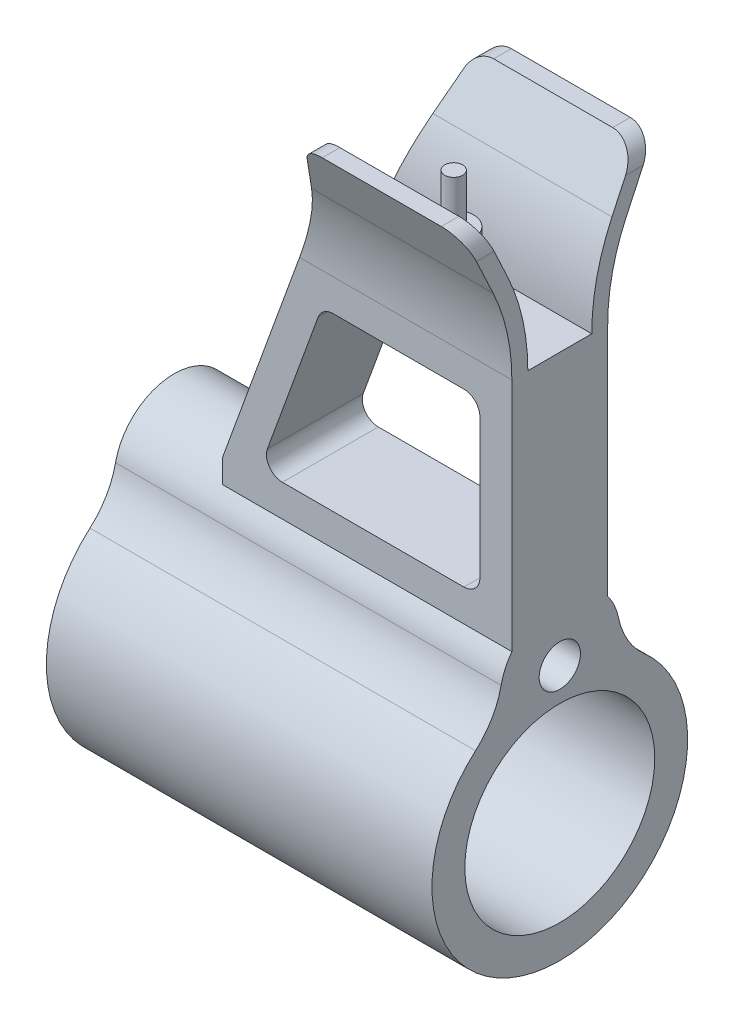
ISO-10303-21;
HEADER;
FILE_DESCRIPTION(('STEP AP214'),'2;1');
FILE_NAME('part.step','',(''),(''),'','','');
FILE_SCHEMA(('AUTOMOTIVE_DESIGN { 1 0 10303 214 1 1 1 1 }'));
ENDSEC;
DATA;
#1=APPLICATION_CONTEXT('core data for automotive mechanical design processes');
#2=APPLICATION_PROTOCOL_DEFINITION('international standard','automotive_design',2000,#1);
#3=PRODUCT_CONTEXT('',#1,'mechanical');
#4=PRODUCT('Part','Part','',(#3));
#5=PRODUCT_RELATED_PRODUCT_CATEGORY('part','',(#4));
#6=PRODUCT_DEFINITION_FORMATION('','',#4);
#7=PRODUCT_DEFINITION_CONTEXT('part definition',#1,'design');
#8=PRODUCT_DEFINITION('design','',#6,#7);
#9=PRODUCT_DEFINITION_SHAPE('','',#8);
#10=(LENGTH_UNIT() NAMED_UNIT(*) SI_UNIT(.MILLI.,.METRE.));
#11=(NAMED_UNIT(*) PLANE_ANGLE_UNIT() SI_UNIT($,.RADIAN.));
#12=(NAMED_UNIT(*) SI_UNIT($,.STERADIAN.) SOLID_ANGLE_UNIT());
#13=UNCERTAINTY_MEASURE_WITH_UNIT(LENGTH_MEASURE(1.E-05),#10,'distance_accuracy_value','');
#14=(GEOMETRIC_REPRESENTATION_CONTEXT(3) GLOBAL_UNCERTAINTY_ASSIGNED_CONTEXT((#13)) GLOBAL_UNIT_ASSIGNED_CONTEXT((#10,
#11,#12)) REPRESENTATION_CONTEXT('',''));
#15=CARTESIAN_POINT('',(0.,0.,0.));
#16=DIRECTION('',(0.,0.,1.));
#17=DIRECTION('',(1.,0.,0.));
#18=AXIS2_PLACEMENT_3D('',#15,#16,#17);
#19=CARTESIAN_POINT('',(10.8465578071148,56.9530302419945,7.9038206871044E-13));
#20=DIRECTION('',(0.,1.,0.));
#21=DIRECTION('',(0.,0.,1.));
#22=AXIS2_PLACEMENT_3D('',#19,#20,#21);
#23=PLANE('',#22);
#24=CARTESIAN_POINT('',(10.8465578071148,56.9530302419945,7.9038206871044E-13));
#25=DIRECTION('',(0.,1.,0.));
#26=DIRECTION('',(0.,0.,1.));
#27=AXIS2_PLACEMENT_3D('',#24,#25,#26);
#28=CIRCLE('',#27,2.5);
#29=CARTESIAN_POINT('',(10.8465578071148,56.9530302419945,2.50000000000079));
#30=VERTEX_POINT('',#29);
#31=EDGE_CURVE('E493',#30,#30,#28,.T.);
#32=ORIENTED_EDGE('',*,*,#31,.T.);
#33=EDGE_LOOP('',(#32));
#34=FACE_BOUND('',#33,.T.);
#35=CARTESIAN_POINT('',(10.8465578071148,56.9530302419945,7.9038206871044E-13));
#36=DIRECTION('',(0.,1.,0.));
#37=DIRECTION('',(0.,0.,1.));
#38=AXIS2_PLACEMENT_3D('',#35,#36,#37);
#39=CIRCLE('',#38,1.125);
#40=CARTESIAN_POINT('',(10.8465578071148,56.9530302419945,1.12500000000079));
#41=VERTEX_POINT('',#40);
#42=EDGE_CURVE('E37',#41,#41,#39,.F.);
#43=ORIENTED_EDGE('',*,*,#42,.T.);
#44=EDGE_LOOP('',(#43));
#45=FACE_BOUND('',#44,.T.);
#46=ADVANCED_FACE('F33',(#34,#45),#23,.T.);
#47=CARTESIAN_POINT('',(-25.,49.9530302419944,4.));
#48=DIRECTION('',(0.,-1.,0.));
#49=DIRECTION('',(0.,0.,-1.));
#50=AXIS2_PLACEMENT_3D('',#47,#48,#49);
#51=PLANE('',#50);
#52=DIRECTION('',(0.,0.,-1.));
#53=VECTOR('',#52,1.);
#54=CARTESIAN_POINT('',(24.13,49.9530302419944,8.56758712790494));
#55=LINE('',#54,#53);
#56=CARTESIAN_POINT('',(24.13,49.9530302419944,4.));
#57=VERTEX_POINT('',#56);
#58=CARTESIAN_POINT('',(24.13,49.9530302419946,-4.));
#59=VERTEX_POINT('',#58);
#60=EDGE_CURVE('E268',#57,#59,#55,.T.);
#61=ORIENTED_EDGE('',*,*,#60,.T.);
#62=DIRECTION('',(1.,0.,0.));
#63=VECTOR('',#62,1.);
#64=CARTESIAN_POINT('',(-25.,49.9530302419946,-4.));
#65=LINE('',#64,#63);
#66=CARTESIAN_POINT('',(-2.43688438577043,49.9530302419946,-4.));
#67=VERTEX_POINT('',#66);
#68=EDGE_CURVE('E503',#67,#59,#65,.T.);
#69=ORIENTED_EDGE('',*,*,#68,.F.);
#70=DIRECTION('',(0.,0.,-1.));
#71=VECTOR('',#70,1.);
#72=CARTESIAN_POINT('',(-2.43688438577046,49.9530302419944,6.00000000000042));
#73=LINE('',#72,#71);
#74=CARTESIAN_POINT('',(-2.43688438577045,49.9530302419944,4.));
#75=VERTEX_POINT('',#74);
#76=EDGE_CURVE('E418',#75,#67,#73,.T.);
#77=ORIENTED_EDGE('',*,*,#76,.F.);
#78=DIRECTION('',(1.,0.,0.));
#79=VECTOR('',#78,1.);
#80=CARTESIAN_POINT('',(-25.,49.9530302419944,4.));
#81=LINE('',#80,#79);
#82=EDGE_CURVE('E260',#75,#57,#81,.T.);
#83=ORIENTED_EDGE('',*,*,#82,.T.);
#84=EDGE_LOOP('',(#61,#69,#77,#83));
#85=FACE_BOUND('',#84,.T.);
#86=CARTESIAN_POINT('',(10.8465578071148,49.9530302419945,6.93237554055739E-13));
#87=DIRECTION('',(0.,-1.,0.));
#88=DIRECTION('',(0.,0.,-1.));
#89=AXIS2_PLACEMENT_3D('',#86,#87,#88);
#90=CIRCLE('',#89,2.5);
#91=CARTESIAN_POINT('',(10.8465578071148,49.9530302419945,-2.49999999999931));
#92=VERTEX_POINT('',#91);
#93=EDGE_CURVE('E12',#92,#92,#90,.F.);
#94=ORIENTED_EDGE('',*,*,#93,.F.);
#95=EDGE_LOOP('',(#94));
#96=FACE_BOUND('',#95,.T.);
#97=ADVANCED_FACE('F622',(#85,#96),#51,.F.);
#98=CARTESIAN_POINT('',(6.23062261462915,67.9953968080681,6.));
#99=DIRECTION('',(0.,-1.,0.));
#100=DIRECTION('',(1.,0.,0.));
#101=AXIS2_PLACEMENT_3D('',#98,#99,#100);
#102=PLANE('',#101);
#103=DIRECTION('',(0.,0.,-1.));
#104=VECTOR('',#103,1.);
#105=CARTESIAN_POINT('',(6.23062261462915,67.9953968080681,6.));
#106=LINE('',#105,#104);
#107=CARTESIAN_POINT('',(6.23062261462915,67.9953968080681,-9.62208988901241));
#108=VERTEX_POINT('',#107);
#109=CARTESIAN_POINT('',(6.23062261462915,67.9953968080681,-11.8288457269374));
#110=VERTEX_POINT('',#109);
#111=EDGE_CURVE('E351',#108,#110,#106,.T.);
#112=ORIENTED_EDGE('',*,*,#111,.F.);
#113=DIRECTION('',(1.,0.,0.));
#114=VECTOR('',#113,1.);
#115=CARTESIAN_POINT('',(6.23062261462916,67.9953968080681,-9.62208988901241));
#116=LINE('',#115,#114);
#117=CARTESIAN_POINT('',(21.13,67.9953968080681,-9.62208988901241));
#118=VERTEX_POINT('',#117);
#119=EDGE_CURVE('E278',#108,#118,#116,.T.);
#120=ORIENTED_EDGE('',*,*,#119,.T.);
#121=DIRECTION('',(0.,0.,-1.));
#122=VECTOR('',#121,1.);
#123=CARTESIAN_POINT('',(21.13,67.9953968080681,6.));
#124=LINE('',#123,#122);
#125=CARTESIAN_POINT('',(21.13,67.9953968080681,-11.8288457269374));
#126=VERTEX_POINT('',#125);
#127=EDGE_CURVE('E355',#118,#126,#124,.T.);
#128=ORIENTED_EDGE('',*,*,#127,.T.);
#129=DIRECTION('',(-1.,0.,0.));
#130=VECTOR('',#129,1.);
#131=CARTESIAN_POINT('',(43.0905494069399,67.9953968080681,-11.8288457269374));
#132=LINE('',#131,#130);
#133=EDGE_CURVE('E299',#126,#110,#132,.T.);
#134=ORIENTED_EDGE('',*,*,#133,.T.);
#135=EDGE_LOOP('',(#112,#120,#128,#134));
#136=FACE_BOUND('',#135,.T.);
#137=ADVANCED_FACE('F628',(#136),#102,.F.);
#138=CARTESIAN_POINT('',(21.13,64.9953968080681,6.));
#139=DIRECTION('',(0.,0.,-1.));
#140=DIRECTION('',(-1.,0.,0.));
#141=AXIS2_PLACEMENT_3D('',#138,#139,#140);
#142=CYLINDRICAL_SURFACE('',#141,3.);
#143=ORIENTED_EDGE('',*,*,#127,.F.);
#144=CARTESIAN_POINT('',(21.13,64.9953968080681,-8.22316691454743));
#145=DIRECTION('',(0.,-0.422618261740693,-0.906307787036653));
#146=DIRECTION('',(0.,0.906307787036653,-0.422618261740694));
#147=AXIS2_PLACEMENT_3D('',#144,#145,#146);
#148=ELLIPSE('',#147,3.31013375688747,3.);
#149=CARTESIAN_POINT('',(24.13,64.995396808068,-8.22316691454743));
#150=VERTEX_POINT('',#149);
#151=EDGE_CURVE('E281',#118,#150,#148,.T.);
#152=ORIENTED_EDGE('',*,*,#151,.T.);
#153=DIRECTION('',(0.,0.,-1.));
#154=VECTOR('',#153,1.);
#155=CARTESIAN_POINT('',(24.13,64.995396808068,6.));
#156=LINE('',#155,#154);
#157=CARTESIAN_POINT('',(24.13,64.9953968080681,-10.4299227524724));
#158=VERTEX_POINT('',#157);
#159=EDGE_CURVE('E359',#150,#158,#156,.T.);
#160=ORIENTED_EDGE('',*,*,#159,.T.);
#161=CARTESIAN_POINT('',(21.13,64.9953968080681,-10.4299227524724));
#162=DIRECTION('',(0.,0.422618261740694,0.906307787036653));
#163=DIRECTION('',(0.,-0.906307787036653,0.422618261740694));
#164=AXIS2_PLACEMENT_3D('',#161,#162,#163);
#165=ELLIPSE('',#164,3.31013375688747,3.);
#166=EDGE_CURVE('E407',#158,#126,#165,.T.);
#167=ORIENTED_EDGE('',*,*,#166,.T.);
#168=EDGE_LOOP('',(#143,#152,#160,#167));
#169=FACE_BOUND('',#168,.T.);
#170=ADVANCED_FACE('F694',(#169),#142,.T.);
#171=CARTESIAN_POINT('',(6.23062261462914,64.9953968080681,6.));
#172=DIRECTION('',(0.,0.,-1.));
#173=DIRECTION('',(-1.,0.,0.));
#174=AXIS2_PLACEMENT_3D('',#171,#172,#173);
#175=CYLINDRICAL_SURFACE('',#174,3.);
#176=DIRECTION('',(0.,0.,-1.));
#177=VECTOR('',#176,1.);
#178=CARTESIAN_POINT('',(3.4115447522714,66.021457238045,6.));
#179=LINE('',#178,#177);
#180=CARTESIAN_POINT('',(3.41154475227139,66.021457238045,-8.70162675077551));
#181=VERTEX_POINT('',#180);
#182=CARTESIAN_POINT('',(3.4115447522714,66.021457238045,-10.9083825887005));
#183=VERTEX_POINT('',#182);
#184=EDGE_CURVE('E347',#181,#183,#179,.T.);
#185=ORIENTED_EDGE('',*,*,#184,.F.);
#186=CARTESIAN_POINT('',(6.23062261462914,64.9953968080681,-8.22316691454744));
#187=DIRECTION('',(0.,-0.422618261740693,-0.906307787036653));
#188=DIRECTION('',(0.,0.906307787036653,-0.422618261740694));
#189=AXIS2_PLACEMENT_3D('',#186,#187,#188);
#190=ELLIPSE('',#189,3.31013375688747,3.);
#191=EDGE_CURVE('E275',#181,#108,#190,.T.);
#192=ORIENTED_EDGE('',*,*,#191,.T.);
#193=ORIENTED_EDGE('',*,*,#111,.T.);
#194=CARTESIAN_POINT('',(6.23062261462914,64.9953968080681,-10.4299227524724));
#195=DIRECTION('',(0.,0.422618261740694,0.906307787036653));
#196=DIRECTION('',(0.,-0.906307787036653,0.422618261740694));
#197=AXIS2_PLACEMENT_3D('',#194,#195,#196);
#198=ELLIPSE('',#197,3.31013375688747,3.);
#199=EDGE_CURVE('E412',#110,#183,#198,.T.);
#200=ORIENTED_EDGE('',*,*,#199,.T.);
#201=EDGE_LOOP('',(#185,#192,#193,#200));
#202=FACE_BOUND('',#201,.T.);
#203=ADVANCED_FACE('F605',(#202),#175,.T.);
#204=CARTESIAN_POINT('',(24.13,17.7773437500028,8.5675871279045));
#205=DIRECTION('',(1.,0.,0.));
#206=DIRECTION('',(0.,0.,-1.));
#207=AXIS2_PLACEMENT_3D('',#204,#205,#206);
#208=PLANE('',#207);
#209=DIRECTION('',(0.,0.906307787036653,-0.422618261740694));
#210=VECTOR('',#209,1.);
#211=CARTESIAN_POINT('',(24.13,19.7795486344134,12.8613293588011));
#212=LINE('',#211,#210);
#213=CARTESIAN_POINT('',(24.13,61.3637233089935,-6.52968975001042));
#214=VERTEX_POINT('',#213);
#215=EDGE_CURVE('E284',#214,#150,#212,.T.);
#216=ORIENTED_EDGE('',*,*,#215,.F.);
#217=CARTESIAN_POINT('',(24.13,49.9530302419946,-31.));
#218=DIRECTION('',(1.,0.,0.));
#219=DIRECTION('',(0.,0.,-1.));
#220=AXIS2_PLACEMENT_3D('',#217,#218,#219);
#221=CIRCLE('',#220,27.);
#222=EDGE_CURVE('E270',#59,#214,#221,.F.);
#223=ORIENTED_EDGE('',*,*,#222,.F.);
#224=ORIENTED_EDGE('',*,*,#60,.F.);
#225=CARTESIAN_POINT('',(24.13,49.9530302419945,31.));
#226=DIRECTION('',(1.,0.,0.));
#227=DIRECTION('',(0.,0.,-1.));
#228=AXIS2_PLACEMENT_3D('',#225,#226,#227);
#229=CIRCLE('',#228,27.);
#230=CARTESIAN_POINT('',(24.13,61.3637233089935,6.52968975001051));
#231=VERTEX_POINT('',#230);
#232=EDGE_CURVE('E251',#231,#57,#229,.F.);
#233=ORIENTED_EDGE('',*,*,#232,.F.);
#234=DIRECTION('',(0.,-0.906307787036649,-0.422618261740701));
#235=VECTOR('',#234,1.);
#236=CARTESIAN_POINT('',(24.13,26.3427011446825,-9.80088108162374));
#237=LINE('',#236,#235);
#238=CARTESIAN_POINT('',(24.13,64.995396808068,8.22316691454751));
#239=VERTEX_POINT('',#238);
#240=EDGE_CURVE('E241',#239,#231,#237,.T.);
#241=ORIENTED_EDGE('',*,*,#240,.F.);
#242=CARTESIAN_POINT('',(24.13,64.995396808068,10.4299227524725));
#243=VERTEX_POINT('',#242);
#244=EDGE_CURVE('E360',#243,#239,#156,.T.);
#245=ORIENTED_EDGE('',*,*,#244,.F.);
#246=DIRECTION('',(0.,-0.906307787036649,-0.422618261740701));
#247=VECTOR('',#246,1.);
#248=CARTESIAN_POINT('',(24.13,60.5184867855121,8.34230532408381));
#249=LINE('',#248,#247);
#250=CARTESIAN_POINT('',(24.13,60.5184867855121,8.34230532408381));
#251=VERTEX_POINT('',#250);
#252=EDGE_CURVE('E319',#243,#251,#249,.T.);
#253=ORIENTED_EDGE('',*,*,#252,.T.);
#254=CARTESIAN_POINT('',(24.13,49.9530302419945,31.));
#255=DIRECTION('',(1.,0.,0.));
#256=DIRECTION('',(0.,0.,-1.));
#257=AXIS2_PLACEMENT_3D('',#254,#255,#256);
#258=CIRCLE('',#257,25.);
#259=CARTESIAN_POINT('',(24.13,49.9530302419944,6.));
#260=VERTEX_POINT('',#259);
#261=EDGE_CURVE('E315',#251,#260,#258,.F.);
#262=ORIENTED_EDGE('',*,*,#261,.T.);
#263=DIRECTION('',(0.,1.,0.));
#264=VECTOR('',#263,1.);
#265=CARTESIAN_POINT('',(24.13,64.995396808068,6.));
#266=LINE('',#265,#264);
#267=CARTESIAN_POINT('',(24.13,20.4999999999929,6.));
#268=VERTEX_POINT('',#267);
#269=EDGE_CURVE('E329',#268,#260,#266,.T.);
#270=ORIENTED_EDGE('',*,*,#269,.F.);
#271=CARTESIAN_POINT('',(24.13,16.,-5.31438987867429E-12));
#272=DIRECTION('',(1.,0.,0.));
#273=DIRECTION('',(0.,0.,-1.));
#274=AXIS2_PLACEMENT_3D('',#271,#272,#273);
#275=CIRCLE('',#274,7.50000000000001);
#276=CARTESIAN_POINT('',(24.13,17.5234375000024,7.34364610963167));
#277=VERTEX_POINT('',#276);
#278=EDGE_CURVE('E545',#268,#277,#275,.T.);
#279=ORIENTED_EDGE('',*,*,#278,.T.);
#280=CARTESIAN_POINT('',(24.13,19.5546875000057,17.1351742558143));
#281=DIRECTION('',(-1.,0.,0.));
#282=DIRECTION('',(0.,0.,-1.));
#283=AXIS2_PLACEMENT_3D('',#280,#281,#282);
#284=CIRCLE('',#283,10.);
#285=CARTESIAN_POINT('',(24.13,12.0336538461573,10.5447226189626));
#286=VERTEX_POINT('',#285);
#287=EDGE_CURVE('E568',#277,#286,#284,.T.);
#288=ORIENTED_EDGE('',*,*,#287,.T.);
#289=CARTESIAN_POINT('',(24.13,0.,0.));
#290=DIRECTION('',(1.,0.,0.));
#291=DIRECTION('',(0.,0.,-1.));
#292=AXIS2_PLACEMENT_3D('',#289,#290,#291);
#293=CIRCLE('',#292,16.);
#294=CARTESIAN_POINT('',(24.13,12.0336538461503,-10.5447226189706));
#295=VERTEX_POINT('',#294);
#296=EDGE_CURVE('E554',#286,#295,#293,.T.);
#297=ORIENTED_EDGE('',*,*,#296,.T.);
#298=CARTESIAN_POINT('',(24.13,19.5546874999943,-17.1351742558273));
#299=DIRECTION('',(-1.,0.,0.));
#300=DIRECTION('',(0.,0.,1.));
#301=AXIS2_PLACEMENT_3D('',#298,#299,#300);
#302=CIRCLE('',#301,10.);
#303=CARTESIAN_POINT('',(24.13,17.5234374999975,-7.34364610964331));
#304=VERTEX_POINT('',#303);
#305=EDGE_CURVE('E551',#295,#304,#302,.T.);
#306=ORIENTED_EDGE('',*,*,#305,.T.);
#307=CARTESIAN_POINT('',(24.13,20.5000000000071,-6.));
#308=VERTEX_POINT('',#307);
#309=EDGE_CURVE('E550',#304,#308,#275,.T.);
#310=ORIENTED_EDGE('',*,*,#309,.T.);
#311=DIRECTION('',(0.,1.,0.));
#312=VECTOR('',#311,1.);
#313=CARTESIAN_POINT('',(24.13,20.1686529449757,-6.));
#314=LINE('',#313,#312);
#315=CARTESIAN_POINT('',(24.13,49.9530302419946,-6.));
#316=VERTEX_POINT('',#315);
#317=EDGE_CURVE('E332',#308,#316,#314,.T.);
#318=ORIENTED_EDGE('',*,*,#317,.T.);
#319=CARTESIAN_POINT('',(24.13,49.9530302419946,-31.));
#320=DIRECTION('',(1.,0.,0.));
#321=DIRECTION('',(0.,0.,-1.));
#322=AXIS2_PLACEMENT_3D('',#319,#320,#321);
#323=CIRCLE('',#322,25.);
#324=CARTESIAN_POINT('',(24.13,60.5184867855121,-8.34230532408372));
#325=VERTEX_POINT('',#324);
#326=EDGE_CURVE('E300',#316,#325,#323,.F.);
#327=ORIENTED_EDGE('',*,*,#326,.T.);
#328=DIRECTION('',(0.,0.906307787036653,-0.422618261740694));
#329=VECTOR('',#328,1.);
#330=CARTESIAN_POINT('',(24.13,67.9953968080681,-11.8288457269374));
#331=LINE('',#330,#329);
#332=EDGE_CURVE('E304',#325,#158,#331,.T.);
#333=ORIENTED_EDGE('',*,*,#332,.T.);
#334=ORIENTED_EDGE('',*,*,#159,.F.);
#335=EDGE_LOOP('',(#216,#223,#224,#233,#241,#245,#253,#262,#270,#279,#288,#297,#306,#310,#318,
#327,#333,#334));
#336=FACE_BOUND('',#335,.T.);
#337=CARTESIAN_POINT('',(24.13,16.,-5.31438987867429E-12));
#338=DIRECTION('',(1.,0.,0.));
#339=DIRECTION('',(0.,0.,-1.));
#340=AXIS2_PLACEMENT_3D('',#337,#338,#339);
#341=CIRCLE('',#340,2.58445);
#342=CARTESIAN_POINT('',(24.13,16.,-2.58445000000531));
#343=VERTEX_POINT('',#342);
#344=EDGE_CURVE('E372',#343,#343,#341,.T.);
#345=ORIENTED_EDGE('',*,*,#344,.F.);
#346=EDGE_LOOP('',(#345));
#347=FACE_BOUND('',#346,.T.);
#348=CARTESIAN_POINT('',(24.13,0.,0.));
#349=DIRECTION('',(1.,0.,0.));
#350=DIRECTION('',(0.,0.,-1.));
#351=AXIS2_PLACEMENT_3D('',#348,#349,#350);
#352=CIRCLE('',#351,11.8872);
#353=CARTESIAN_POINT('',(24.13,0.,-11.8872));
#354=VERTEX_POINT('',#353);
#355=EDGE_CURVE('E562',#354,#354,#352,.T.);
#356=ORIENTED_EDGE('',*,*,#355,.F.);
#357=EDGE_LOOP('',(#356));
#358=FACE_BOUND('',#357,.T.);
#359=ADVANCED_FACE('F265',(#336,#347,#358),#208,.T.);
#360=CARTESIAN_POINT('',(21.13,67.9953968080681,11.8288457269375));
#361=VERTEX_POINT('',#360);
#362=CARTESIAN_POINT('',(21.13,67.9953968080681,9.62208988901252));
#363=VERTEX_POINT('',#362);
#364=EDGE_CURVE('E356',#361,#363,#124,.T.);
#365=ORIENTED_EDGE('',*,*,#364,.T.);
#366=DIRECTION('',(-1.,0.,0.));
#367=VECTOR('',#366,1.);
#368=CARTESIAN_POINT('',(6.23062261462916,67.9953968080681,9.62208988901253));
#369=LINE('',#368,#367);
#370=CARTESIAN_POINT('',(6.23062261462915,67.9953968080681,9.62208988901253));
#371=VERTEX_POINT('',#370);
#372=EDGE_CURVE('E509',#363,#371,#369,.T.);
#373=ORIENTED_EDGE('',*,*,#372,.T.);
#374=CARTESIAN_POINT('',(6.23062261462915,67.9953968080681,11.8288457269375));
#375=VERTEX_POINT('',#374);
#376=EDGE_CURVE('E352',#375,#371,#106,.T.);
#377=ORIENTED_EDGE('',*,*,#376,.F.);
#378=DIRECTION('',(-1.,0.,0.));
#379=VECTOR('',#378,1.);
#380=CARTESIAN_POINT('',(43.0905494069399,67.9953968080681,11.8288457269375));
#381=LINE('',#380,#379);
#382=EDGE_CURVE('E303',#361,#375,#381,.T.);
#383=ORIENTED_EDGE('',*,*,#382,.F.);
#384=EDGE_LOOP('',(#365,#373,#377,#383));
#385=FACE_BOUND('',#384,.T.);
#386=ADVANCED_FACE('F515',(#385),#102,.F.);
#387=CARTESIAN_POINT('',(43.0905494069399,60.5184867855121,8.34230532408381));
#388=DIRECTION('',(0.,0.422618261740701,-0.906307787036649));
#389=DIRECTION('',(0.,0.906307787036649,0.422618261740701));
#390=AXIS2_PLACEMENT_3D('',#387,#388,#389);
#391=PLANE('',#390);
#392=CARTESIAN_POINT('',(6.23062261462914,64.9953968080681,10.4299227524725));
#393=DIRECTION('',(0.,0.422618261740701,-0.906307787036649));
#394=DIRECTION('',(0.,0.906307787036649,0.422618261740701));
#395=AXIS2_PLACEMENT_3D('',#392,#393,#394);
#396=ELLIPSE('',#395,3.31013375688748,3.);
#397=CARTESIAN_POINT('',(3.4115447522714,66.021457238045,10.9083825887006));
#398=VERTEX_POINT('',#397);
#399=EDGE_CURVE('E296',#398,#375,#396,.T.);
#400=ORIENTED_EDGE('',*,*,#399,.F.);
#401=DIRECTION('',(0.313265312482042,0.860689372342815,0.401346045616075));
#402=VECTOR('',#401,1.);
#403=CARTESIAN_POINT('',(5.49908923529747,71.7569385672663,13.5828814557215));
#404=LINE('',#403,#402);
#405=CARTESIAN_POINT('',(1.40862730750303,60.5184867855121,8.34230532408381));
#406=VERTEX_POINT('',#405);
#407=EDGE_CURVE('E293',#406,#398,#404,.T.);
#408=ORIENTED_EDGE('',*,*,#407,.F.);
#409=DIRECTION('',(-1.,0.,0.));
#410=VECTOR('',#409,1.);
#411=CARTESIAN_POINT('',(43.0905494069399,60.5184867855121,8.34230532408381));
#412=LINE('',#411,#410);
#413=EDGE_CURVE('E324',#251,#406,#412,.T.);
#414=ORIENTED_EDGE('',*,*,#413,.F.);
#415=ORIENTED_EDGE('',*,*,#252,.F.);
#416=CARTESIAN_POINT('',(21.13,64.9953968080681,10.4299227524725));
#417=DIRECTION('',(0.,0.422618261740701,-0.906307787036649));
#418=DIRECTION('',(0.,0.906307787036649,0.422618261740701));
#419=AXIS2_PLACEMENT_3D('',#416,#417,#418);
#420=ELLIPSE('',#419,3.31013375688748,3.);
#421=EDGE_CURVE('E286',#361,#243,#420,.T.);
#422=ORIENTED_EDGE('',*,*,#421,.F.);
#423=ORIENTED_EDGE('',*,*,#382,.T.);
#424=EDGE_LOOP('',(#400,#408,#414,#415,#422,#423));
#425=FACE_BOUND('',#424,.T.);
#426=ADVANCED_FACE('F518',(#425),#391,.F.);
#427=CARTESIAN_POINT('',(43.0905494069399,49.9530302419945,31.));
#428=DIRECTION('',(-1.,0.,0.));
#429=DIRECTION('',(0.,0.,1.));
#430=AXIS2_PLACEMENT_3D('',#427,#428,#429);
#431=CYLINDRICAL_SURFACE('',#430,25.);
#432=CARTESIAN_POINT('',(-2.43688438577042,49.9530302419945,31.));
#433=DIRECTION('',(-0.93969262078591,0.342020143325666,0.));
#434=DIRECTION('',(-0.342020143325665,-0.93969262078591,0.));
#435=AXIS2_PLACEMENT_3D('',#432,#433,#434);
#436=ELLIPSE('',#435,26.6044443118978,25.);
#437=CARTESIAN_POINT('',(-2.43688438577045,49.9530302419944,6.));
#438=VERTEX_POINT('',#437);
#439=EDGE_CURVE('E291',#438,#406,#436,.F.);
#440=ORIENTED_EDGE('',*,*,#439,.F.);
#441=DIRECTION('',(-1.,0.,0.));
#442=VECTOR('',#441,1.);
#443=CARTESIAN_POINT('',(43.0905494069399,49.9530302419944,6.));
#444=LINE('',#443,#442);
#445=EDGE_CURVE('E321',#260,#438,#444,.T.);
#446=ORIENTED_EDGE('',*,*,#445,.F.);
#447=ORIENTED_EDGE('',*,*,#261,.F.);
#448=ORIENTED_EDGE('',*,*,#413,.T.);
#449=EDGE_LOOP('',(#440,#446,#447,#448));
#450=FACE_BOUND('',#449,.T.);
#451=ADVANCED_FACE('F526',(#450),#431,.F.);
#452=CARTESIAN_POINT('',(43.0905494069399,49.9530302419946,-31.));
#453=DIRECTION('',(-1.,0.,0.));
#454=DIRECTION('',(0.,0.,1.));
#455=AXIS2_PLACEMENT_3D('',#452,#453,#454);
#456=CYLINDRICAL_SURFACE('',#455,25.);
#457=CARTESIAN_POINT('',(-2.43688438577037,49.9530302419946,-31.));
#458=DIRECTION('',(-0.93969262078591,0.342020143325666,0.));
#459=DIRECTION('',(-0.342020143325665,-0.93969262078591,0.));
#460=AXIS2_PLACEMENT_3D('',#457,#458,#459);
#461=ELLIPSE('',#460,26.6044443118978,25.);
#462=CARTESIAN_POINT('',(1.40862730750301,60.5184867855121,-8.34230532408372));
#463=VERTEX_POINT('',#462);
#464=CARTESIAN_POINT('',(-2.43688438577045,49.9530302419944,-6.));
#465=VERTEX_POINT('',#464);
#466=EDGE_CURVE('E289',#463,#465,#461,.F.);
#467=ORIENTED_EDGE('',*,*,#466,.F.);
#468=DIRECTION('',(-1.,0.,0.));
#469=VECTOR('',#468,1.);
#470=CARTESIAN_POINT('',(43.0905494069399,60.5184867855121,-8.34230532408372));
#471=LINE('',#470,#469);
#472=EDGE_CURVE('E307',#325,#463,#471,.T.);
#473=ORIENTED_EDGE('',*,*,#472,.F.);
#474=ORIENTED_EDGE('',*,*,#326,.F.);
#475=DIRECTION('',(-1.,0.,0.));
#476=VECTOR('',#475,1.);
#477=CARTESIAN_POINT('',(43.0905494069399,49.9530302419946,-6.));
#478=LINE('',#477,#476);
#479=EDGE_CURVE('E308',#316,#465,#478,.T.);
#480=ORIENTED_EDGE('',*,*,#479,.T.);
#481=EDGE_LOOP('',(#467,#473,#474,#480));
#482=FACE_BOUND('',#481,.T.);
#483=ADVANCED_FACE('F669',(#482),#456,.F.);
#484=CARTESIAN_POINT('',(43.0905494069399,67.9953968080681,-11.8288457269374));
#485=DIRECTION('',(0.,0.422618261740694,0.906307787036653));
#486=DIRECTION('',(0.,-0.906307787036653,0.422618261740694));
#487=AXIS2_PLACEMENT_3D('',#484,#485,#486);
#488=PLANE('',#487);
#489=ORIENTED_EDGE('',*,*,#199,.F.);
#490=ORIENTED_EDGE('',*,*,#133,.F.);
#491=ORIENTED_EDGE('',*,*,#166,.F.);
#492=ORIENTED_EDGE('',*,*,#332,.F.);
#493=ORIENTED_EDGE('',*,*,#472,.T.);
#494=DIRECTION('',(-0.313265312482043,-0.860689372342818,0.401346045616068));
#495=VECTOR('',#494,1.);
#496=CARTESIAN_POINT('',(7.95339959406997,78.5001008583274,-16.7272696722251));
#497=LINE('',#496,#495);
#498=EDGE_CURVE('E410',#183,#463,#497,.T.);
#499=ORIENTED_EDGE('',*,*,#498,.F.);
#500=EDGE_LOOP('',(#489,#490,#491,#492,#493,#499));
#501=FACE_BOUND('',#500,.T.);
#502=ADVANCED_FACE('F666',(#501),#488,.F.);
#503=CARTESIAN_POINT('',(24.13,16.,-5.31438987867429E-12));
#504=DIRECTION('',(-1.,0.,0.));
#505=DIRECTION('',(0.,0.,1.));
#506=AXIS2_PLACEMENT_3D('',#503,#504,#505);
#507=CYLINDRICAL_SURFACE('',#506,7.50000000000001);
#508=DIRECTION('',(-1.,0.,0.));
#509=VECTOR('',#508,1.);
#510=CARTESIAN_POINT('',(24.13,20.4999999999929,6.));
#511=LINE('',#510,#509);
#512=CARTESIAN_POINT('',(-12.065,20.4999999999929,6.));
#513=VERTEX_POINT('',#512);
#514=EDGE_CURVE('E405',#513,#268,#511,.F.);
#515=ORIENTED_EDGE('',*,*,#514,.F.);
#516=CARTESIAN_POINT('',(-12.065,16.,-5.31438987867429E-12));
#517=DIRECTION('',(1.,0.,0.));
#518=DIRECTION('',(0.,0.,-1.));
#519=AXIS2_PLACEMENT_3D('',#516,#517,#518);
#520=CIRCLE('',#519,7.50000000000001);
#521=CARTESIAN_POINT('',(-12.065,23.5,-5.31438987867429E-12));
#522=VERTEX_POINT('',#521);
#523=EDGE_CURVE('E404',#522,#513,#520,.T.);
#524=ORIENTED_EDGE('',*,*,#523,.F.);
#525=CARTESIAN_POINT('',(-12.065,20.5000000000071,-6.));
#526=VERTEX_POINT('',#525);
#527=EDGE_CURVE('E402',#526,#522,#520,.T.);
#528=ORIENTED_EDGE('',*,*,#527,.F.);
#529=DIRECTION('',(-1.,0.,0.));
#530=VECTOR('',#529,1.);
#531=CARTESIAN_POINT('',(24.13,20.5000000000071,-6.));
#532=LINE('',#531,#530);
#533=EDGE_CURVE('E399',#526,#308,#532,.F.);
#534=ORIENTED_EDGE('',*,*,#533,.T.);
#535=ORIENTED_EDGE('',*,*,#309,.F.);
#536=DIRECTION('',(-1.,0.,0.));
#537=VECTOR('',#536,1.);
#538=CARTESIAN_POINT('',(24.13,17.5234374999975,-7.34364610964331));
#539=LINE('',#538,#537);
#540=CARTESIAN_POINT('',(-24.13,17.5234374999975,-7.34364610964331));
#541=VERTEX_POINT('',#540);
#542=EDGE_CURVE('E570',#304,#541,#539,.T.);
#543=ORIENTED_EDGE('',*,*,#542,.T.);
#544=CARTESIAN_POINT('',(-24.13,16.,-5.31438987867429E-12));
#545=DIRECTION('',(1.,0.,0.));
#546=DIRECTION('',(0.,0.,-1.));
#547=AXIS2_PLACEMENT_3D('',#544,#545,#546);
#548=CIRCLE('',#547,7.50000000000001);
#549=CARTESIAN_POINT('',(-24.13,17.5234375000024,7.34364610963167));
#550=VERTEX_POINT('',#549);
#551=EDGE_CURVE('E566',#541,#550,#548,.T.);
#552=ORIENTED_EDGE('',*,*,#551,.T.);
#553=DIRECTION('',(-1.,0.,0.));
#554=VECTOR('',#553,1.);
#555=CARTESIAN_POINT('',(24.13,17.5234375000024,7.34364610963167));
#556=LINE('',#555,#554);
#557=EDGE_CURVE('E547',#277,#550,#556,.T.);
#558=ORIENTED_EDGE('',*,*,#557,.F.);
#559=ORIENTED_EDGE('',*,*,#278,.F.);
#560=EDGE_LOOP('',(#515,#524,#528,#534,#535,#543,#552,#558,#559));
#561=FACE_BOUND('',#560,.T.);
#562=ADVANCED_FACE('F542',(#561),#507,.T.);
#563=CARTESIAN_POINT('',(24.13,0.,0.));
#564=DIRECTION('',(-1.,0.,0.));
#565=DIRECTION('',(0.,0.,1.));
#566=AXIS2_PLACEMENT_3D('',#563,#564,#565);
#567=CYLINDRICAL_SURFACE('',#566,11.8872);
#568=CARTESIAN_POINT('',(-24.13,0.,0.));
#569=DIRECTION('',(1.,0.,0.));
#570=DIRECTION('',(0.,0.,-1.));
#571=AXIS2_PLACEMENT_3D('',#568,#569,#570);
#572=CIRCLE('',#571,11.8872);
#573=CARTESIAN_POINT('',(-24.13,0.,-11.8872));
#574=VERTEX_POINT('',#573);
#575=EDGE_CURVE('E593',#574,#574,#572,.T.);
#576=ORIENTED_EDGE('',*,*,#575,.F.);
#577=EDGE_LOOP('',(#576));
#578=FACE_BOUND('',#577,.T.);
#579=ORIENTED_EDGE('',*,*,#355,.T.);
#580=EDGE_LOOP('',(#579));
#581=FACE_BOUND('',#580,.T.);
#582=CARTESIAN_POINT('',(-16.51,11.7807201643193,-1.5875));
#583=CARTESIAN_POINT('',(-16.5987429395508,11.7807215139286,-1.58749625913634));
#584=CARTESIAN_POINT('',(-16.687540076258,11.7817337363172,-1.58003363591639));
#585=CARTESIAN_POINT('',(-16.8626594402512,11.7856713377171,-1.55038382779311));
#586=CARTESIAN_POINT('',(-16.9489790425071,11.7885986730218,-1.52818158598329));
#587=CARTESIAN_POINT('',(-17.1165827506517,11.796029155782,-1.46972193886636));
#588=CARTESIAN_POINT('',(-17.1978703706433,11.8005311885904,-1.43347447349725));
#589=CARTESIAN_POINT('',(-17.3531952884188,11.8106024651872,-1.34797531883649));
#590=CARTESIAN_POINT('',(-17.4272337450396,11.8161715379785,-1.29872571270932));
#591=CARTESIAN_POINT('',(-17.566444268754,11.8277891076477,-1.18828461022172));
#592=CARTESIAN_POINT('',(-17.6315634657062,11.8338401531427,-1.12702673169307));
#593=CARTESIAN_POINT('',(-17.7506297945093,11.845717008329,-0.994451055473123));
#594=CARTESIAN_POINT('',(-17.8045763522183,11.8515428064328,-0.923132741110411));
#595=CARTESIAN_POINT('',(-17.8999576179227,11.8623390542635,-0.772126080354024));
#596=CARTESIAN_POINT('',(-17.9413441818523,11.8673061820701,-0.6924070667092));
#597=CARTESIAN_POINT('',(-18.0101220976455,11.8757973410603,-0.527072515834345));
#598=CARTESIAN_POINT('',(-18.0375140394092,11.8793214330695,-0.441457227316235));
#599=CARTESIAN_POINT('',(-18.0773663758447,11.8845114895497,-0.26730260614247));
#600=CARTESIAN_POINT('',(-18.089914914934,11.886188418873,-0.178783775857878));
#601=CARTESIAN_POINT('',(-18.0999975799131,11.8875326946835,-0.000881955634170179));
#602=CARTESIAN_POINT('',(-18.0975323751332,11.8872001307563,0.0885009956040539));
#603=CARTESIAN_POINT('',(-18.0777278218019,11.8845717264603,0.264993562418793));
#604=CARTESIAN_POINT('',(-18.0604832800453,11.8822884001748,0.352114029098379));
#605=CARTESIAN_POINT('',(-18.0117579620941,11.8760290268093,0.522213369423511));
#606=CARTESIAN_POINT('',(-17.9802768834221,11.8720529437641,0.60519215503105));
#607=CARTESIAN_POINT('',(-17.9038725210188,11.8628332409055,0.764944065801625));
#608=CARTESIAN_POINT('',(-17.8589085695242,11.8575857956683,0.841697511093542));
#609=CARTESIAN_POINT('',(-17.7568444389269,11.8464097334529,0.986605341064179));
#610=CARTESIAN_POINT('',(-17.6997436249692,11.8404810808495,1.05475927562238));
#611=CARTESIAN_POINT('',(-17.5744965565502,11.8285507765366,1.18109104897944));
#612=CARTESIAN_POINT('',(-17.506267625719,11.8225489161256,1.23918693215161));
#613=CARTESIAN_POINT('',(-17.3609840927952,11.8111941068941,1.34311554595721));
#614=CARTESIAN_POINT('',(-17.2839294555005,11.8058411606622,1.38894822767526));
#615=CARTESIAN_POINT('',(-17.1231048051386,11.7963903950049,1.46705614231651));
#616=CARTESIAN_POINT('',(-17.0393312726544,11.7922932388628,1.49932421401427));
#617=CARTESIAN_POINT('',(-16.8674874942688,11.7858304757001,1.54931113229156));
#618=CARTESIAN_POINT('',(-16.7794174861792,11.7834647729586,1.56703078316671));
#619=CARTESIAN_POINT('',(-16.6022062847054,11.7807505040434,1.58730808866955));
#620=CARTESIAN_POINT('',(-16.5130785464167,11.7803865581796,1.58998134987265));
#621=CARTESIAN_POINT('',(-16.3356464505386,11.7816762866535,1.58039557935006));
#622=CARTESIAN_POINT('',(-16.2473420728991,11.7833299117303,1.56813691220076));
#623=CARTESIAN_POINT('',(-16.0744135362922,11.7884543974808,1.52913283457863));
#624=CARTESIAN_POINT('',(-15.9897764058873,11.79191816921,1.50244392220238));
#625=CARTESIAN_POINT('',(-15.8261780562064,11.8002668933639,1.43539530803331));
#626=CARTESIAN_POINT('',(-15.747217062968,11.8051519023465,1.39503506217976));
#627=CARTESIAN_POINT('',(-15.5966909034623,11.8158293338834,1.30150731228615));
#628=CARTESIAN_POINT('',(-15.5251730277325,11.8216270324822,1.24826430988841));
#629=CARTESIAN_POINT('',(-15.3920469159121,11.8334602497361,1.13058857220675));
#630=CARTESIAN_POINT('',(-15.3304391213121,11.8394957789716,1.06615533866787));
#631=CARTESIAN_POINT('',(-15.2184729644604,11.8511721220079,0.927421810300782));
#632=CARTESIAN_POINT('',(-15.1681907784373,11.856810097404,0.85305976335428));
#633=CARTESIAN_POINT('',(-15.0808314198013,11.8670131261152,0.696877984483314));
#634=CARTESIAN_POINT('',(-15.0437539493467,11.8715782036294,0.615058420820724));
#635=CARTESIAN_POINT('',(-14.9839810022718,11.8791085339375,0.446532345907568));
#636=CARTESIAN_POINT('',(-14.9612422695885,11.8820785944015,0.359841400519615));
#637=CARTESIAN_POINT('',(-14.9306517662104,11.8861042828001,0.183829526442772));
#638=CARTESIAN_POINT('',(-14.9227992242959,11.8871600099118,0.0945087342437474));
#639=CARTESIAN_POINT('',(-14.9222198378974,11.8872374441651,-0.0834851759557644));
#640=CARTESIAN_POINT('',(-14.9293758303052,11.8862749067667,-0.172157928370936));
#641=CARTESIAN_POINT('',(-14.9583612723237,11.8824554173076,-0.347028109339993));
#642=CARTESIAN_POINT('',(-14.9801907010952,11.8795984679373,-0.433225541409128));
#643=CARTESIAN_POINT('',(-15.0378649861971,11.8723096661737,-0.600677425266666));
#644=CARTESIAN_POINT('',(-15.0737034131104,11.867878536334,-0.68193412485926));
#645=CARTESIAN_POINT('',(-15.1583661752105,11.8579307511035,-0.837298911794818));
#646=CARTESIAN_POINT('',(-15.2071907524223,11.8524140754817,-0.911406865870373));
#647=CARTESIAN_POINT('',(-15.3168703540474,11.8408588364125,-1.05096783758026));
#648=CARTESIAN_POINT('',(-15.3778123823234,11.8348166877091,-1.11635218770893));
#649=CARTESIAN_POINT('',(-15.5098149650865,11.8229195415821,-1.23601085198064));
#650=CARTESIAN_POINT('',(-15.5808779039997,11.8170645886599,-1.29028254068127));
#651=CARTESIAN_POINT('',(-15.7314681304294,11.8061771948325,-1.38638387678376));
#652=CARTESIAN_POINT('',(-15.8110313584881,11.8011484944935,-1.42815760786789));
#653=CARTESIAN_POINT('',(-15.9760689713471,11.7925267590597,-1.49768986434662));
#654=CARTESIAN_POINT('',(-16.0615369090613,11.7889321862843,-1.52546340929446));
#655=CARTESIAN_POINT('',(-16.2078576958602,11.784444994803,-1.55966812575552));
#656=CARTESIAN_POINT('',(-16.2677933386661,11.7830552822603,-1.5700897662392));
#657=CARTESIAN_POINT('',(-16.3884775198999,11.7811924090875,-1.58400695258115));
#658=CARTESIAN_POINT('',(-16.4492260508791,11.7807192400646,-1.58750256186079));
#659=CARTESIAN_POINT('',(-16.51,11.7807201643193,-1.5875));
#660=B_SPLINE_CURVE_WITH_KNOTS('',3,(#582,#583,#584,#585,#586,#587,#588,#589,#590,#591,#592,
#593,#594,#595,#596,#597,#598,#599,#600,#601,#602,#603,#604,#605,#606,#607,#608,#609,#610,#611,
#612,#613,#614,#615,#616,#617,#618,#619,#620,#621,#622,#623,#624,#625,#626,#627,#628,#629,#630,
#631,#632,#633,#634,#635,#636,#637,#638,#639,#640,#641,#642,#643,#644,#645,#646,#647,#648,#649,
#650,#651,#652,#653,#654,#655,#656,#657,#658,#659),.UNSPECIFIED.,.T.,.F.,(4,2,2,2,2,2,2,2,2,2,2,
2,2,2,2,2,2,2,2,2,2,2,2,2,2,2,2,2,2,2,2,2,2,2,2,2,2,2,4),(0.,0.266006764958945,
0.532285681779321,0.798376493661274,1.06442469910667,1.33198735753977,1.59956376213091,
1.86815323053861,2.13673137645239,2.40370649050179,2.67066970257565,2.9359331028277,
3.20120213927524,3.46727948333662,3.73337074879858,4.0015374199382,4.26970516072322,
4.53801429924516,4.80630860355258,5.07253866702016,5.33876223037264,5.60395092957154,
5.86915018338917,6.135942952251,6.40274760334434,6.67129649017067,6.93983931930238,
7.20756810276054,7.47528301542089,7.74091581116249,8.00654822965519,8.27205887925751,
8.53757447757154,8.80507020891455,9.07262906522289,9.3413676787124,9.60981736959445,
9.79198881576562,9.97415859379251),.UNSPECIFIED.);
#661=CARTESIAN_POINT('',(-16.51,11.7807201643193,-1.5875));
#662=VERTEX_POINT('',#661);
#663=EDGE_CURVE('E363',#662,#662,#660,.T.);
#664=ORIENTED_EDGE('',*,*,#663,.T.);
#665=EDGE_LOOP('',(#664));
#666=FACE_BOUND('',#665,.T.);
#667=ADVANCED_FACE('F374',(#578,#581,#666),#567,.F.);
#668=CARTESIAN_POINT('',(24.13,16.,-5.31438987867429E-12));
#669=DIRECTION('',(-1.,0.,0.));
#670=DIRECTION('',(0.,0.,1.));
#671=AXIS2_PLACEMENT_3D('',#668,#669,#670);
#672=CYLINDRICAL_SURFACE('',#671,2.58445);
#673=CARTESIAN_POINT('',(-24.13,16.,-5.31438987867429E-12));
#674=DIRECTION('',(1.,0.,0.));
#675=DIRECTION('',(0.,0.,-1.));
#676=AXIS2_PLACEMENT_3D('',#673,#674,#675);
#677=CIRCLE('',#676,2.58445);
#678=CARTESIAN_POINT('',(-24.13,16.,-2.58445000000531));
#679=VERTEX_POINT('',#678);
#680=EDGE_CURVE('E371',#679,#679,#677,.T.);
#681=ORIENTED_EDGE('',*,*,#680,.F.);
#682=EDGE_LOOP('',(#681));
#683=FACE_BOUND('',#682,.T.);
#684=ORIENTED_EDGE('',*,*,#344,.T.);
#685=EDGE_LOOP('',(#684));
#686=FACE_BOUND('',#685,.T.);
#687=CARTESIAN_POINT('',(-16.51,13.9605820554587,-1.5875));
#688=CARTESIAN_POINT('',(-16.4307581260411,13.9605731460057,-1.58749422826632));
#689=CARTESIAN_POINT('',(-16.3513779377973,13.9558782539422,-1.58151296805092));
#690=CARTESIAN_POINT('',(-16.1952520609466,13.9379092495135,-1.55800069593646));
#691=CARTESIAN_POINT('',(-16.1185147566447,13.9246100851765,-1.54043595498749));
#692=CARTESIAN_POINT('',(-15.9704087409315,13.8916349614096,-1.49497536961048));
#693=CARTESIAN_POINT('',(-15.8990007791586,13.8720128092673,-1.46716642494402));
#694=CARTESIAN_POINT('',(-15.7619527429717,13.8286954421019,-1.40226168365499));
#695=CARTESIAN_POINT('',(-15.6963124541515,13.8050003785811,-1.36516623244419));
#696=CARTESIAN_POINT('',(-15.563339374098,13.7525147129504,-1.27716088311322));
#697=CARTESIAN_POINT('',(-15.4968809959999,13.7234611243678,-1.2250861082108));
#698=CARTESIAN_POINT('',(-15.3729054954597,13.6656473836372,-1.11098043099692));
#699=CARTESIAN_POINT('',(-15.3153959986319,13.6368875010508,-1.04894112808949));
#700=CARTESIAN_POINT('',(-15.2044011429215,13.5789835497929,-0.908021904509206));
#701=CARTESIAN_POINT('',(-15.152139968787,13.550175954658,-0.828025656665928));
#702=CARTESIAN_POINT('',(-15.0622314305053,13.4992226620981,-0.658269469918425));
#703=CARTESIAN_POINT('',(-15.0245700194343,13.4770705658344,-0.568519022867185));
#704=CARTESIAN_POINT('',(-14.9689310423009,13.4438948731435,-0.391180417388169));
#705=CARTESIAN_POINT('',(-14.9493740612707,13.4319867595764,-0.30425762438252));
#706=CARTESIAN_POINT('',(-14.9251383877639,13.417188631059,-0.127637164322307));
#707=CARTESIAN_POINT('',(-14.9204447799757,13.4142895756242,-0.0379423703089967));
#708=CARTESIAN_POINT('',(-14.9258437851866,13.4176020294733,0.129105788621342));
#709=CARTESIAN_POINT('',(-14.9340966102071,13.4226800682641,0.206550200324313));
#710=CARTESIAN_POINT('',(-14.9616259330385,13.4394203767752,0.358706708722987));
#711=CARTESIAN_POINT('',(-14.9809032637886,13.4510831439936,0.433418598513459));
#712=CARTESIAN_POINT('',(-15.0296926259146,13.4800495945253,0.578565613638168));
#713=CARTESIAN_POINT('',(-15.0592455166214,13.4973757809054,0.648982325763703));
#714=CARTESIAN_POINT('',(-15.1274881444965,13.5363076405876,0.783926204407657));
#715=CARTESIAN_POINT('',(-15.1661800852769,13.5579143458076,0.84845194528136));
#716=CARTESIAN_POINT('',(-15.2569247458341,13.606721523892,0.978251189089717));
#717=CARTESIAN_POINT('',(-15.3100330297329,13.6342829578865,1.04264998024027));
#718=CARTESIAN_POINT('',(-15.4253778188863,13.6906502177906,1.16218049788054));
#719=CARTESIAN_POINT('',(-15.4876272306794,13.7194577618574,1.21729888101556));
#720=CARTESIAN_POINT('',(-15.628606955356,13.7793015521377,1.32364750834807));
#721=CARTESIAN_POINT('',(-15.7084239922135,13.8101700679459,1.37354403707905));
#722=CARTESIAN_POINT('',(-15.8772146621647,13.866140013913,1.45898710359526));
#723=CARTESIAN_POINT('',(-15.9661709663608,13.8912520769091,1.49456019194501));
#724=CARTESIAN_POINT('',(-16.1274118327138,13.9260917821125,1.54237705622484));
#725=CARTESIAN_POINT('',(-16.1981181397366,13.9381135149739,1.55826470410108));
#726=CARTESIAN_POINT('',(-16.3418477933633,13.9549003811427,1.58023690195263));
#727=CARTESIAN_POINT('',(-16.4148680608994,13.9596747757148,1.5863339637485));
#728=CARTESIAN_POINT('',(-16.5612749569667,13.961253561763,1.58836312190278));
#729=CARTESIAN_POINT('',(-16.6346620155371,13.9580430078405,1.58427615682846));
#730=CARTESIAN_POINT('',(-16.7794885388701,13.9441213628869,1.56616355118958));
#731=CARTESIAN_POINT('',(-16.8509263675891,13.9334041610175,1.55212981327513));
#732=CARTESIAN_POINT('',(-16.9894263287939,13.9060813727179,1.5150589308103));
#733=CARTESIAN_POINT('',(-17.0565237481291,13.8895330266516,1.49210909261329));
#734=CARTESIAN_POINT('',(-17.1861015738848,13.8523318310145,1.43804659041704));
#735=CARTESIAN_POINT('',(-17.2485802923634,13.8316774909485,1.40693096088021));
#736=CARTESIAN_POINT('',(-17.3795007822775,13.7839506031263,1.33074454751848));
#737=CARTESIAN_POINT('',(-17.4468840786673,13.7563992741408,1.2841537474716));
#738=CARTESIAN_POINT('',(-17.5736019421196,13.7006009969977,1.18134431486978));
#739=CARTESIAN_POINT('',(-17.6329282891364,13.6723533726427,1.1251159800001));
#740=CARTESIAN_POINT('',(-17.7506831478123,13.6134646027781,0.994815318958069));
#741=CARTESIAN_POINT('',(-17.8077005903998,13.5830810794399,0.919335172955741));
#742=CARTESIAN_POINT('',(-17.9080824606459,13.5277320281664,0.757977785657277));
#743=CARTESIAN_POINT('',(-17.9514545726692,13.5027634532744,0.672106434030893));
#744=CARTESIAN_POINT('',(-18.0200472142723,13.4625308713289,0.498066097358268));
#745=CARTESIAN_POINT('',(-18.0462767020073,13.4467351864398,0.410422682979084));
#746=CARTESIAN_POINT('',(-18.0832914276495,13.4242964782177,0.230834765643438));
#747=CARTESIAN_POINT('',(-18.0940963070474,13.4176418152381,0.138895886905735));
#748=CARTESIAN_POINT('',(-18.0991470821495,13.4145372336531,-0.0325141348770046));
#749=CARTESIAN_POINT('',(-18.0955206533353,13.4167760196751,-0.111907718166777));
#750=CARTESIAN_POINT('',(-18.0765780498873,13.4283594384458,-0.268747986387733));
#751=CARTESIAN_POINT('',(-18.0612620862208,13.4377039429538,-0.346194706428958));
#752=CARTESIAN_POINT('',(-18.0202721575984,13.4623064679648,-0.495016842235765));
#753=CARTESIAN_POINT('',(-17.9948809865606,13.4774026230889,-0.566498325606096));
#754=CARTESIAN_POINT('',(-17.9347685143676,13.5123117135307,-0.704156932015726));
#755=CARTESIAN_POINT('',(-17.9000454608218,13.5321255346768,-0.770333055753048));
#756=CARTESIAN_POINT('',(-17.818154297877,13.5773559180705,-0.903108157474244));
#757=CARTESIAN_POINT('',(-17.7700558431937,13.6031441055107,-0.969004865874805));
#758=CARTESIAN_POINT('',(-17.6648347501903,13.6567505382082,-1.09228803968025));
#759=CARTESIAN_POINT('',(-17.6077017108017,13.6845711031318,-1.14966454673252));
#760=CARTESIAN_POINT('',(-17.4769320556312,13.7438257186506,-1.26239610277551));
#761=CARTESIAN_POINT('',(-17.4021066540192,13.775232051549,-1.3163946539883));
#762=CARTESIAN_POINT('',(-17.2430460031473,13.8340933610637,-1.41115073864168));
#763=CARTESIAN_POINT('',(-17.1588173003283,13.8615510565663,-1.45191740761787));
#764=CARTESIAN_POINT('',(-17.0021353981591,13.9030839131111,-1.51106908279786));
#765=CARTESIAN_POINT('',(-16.9312292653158,13.9187772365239,-1.5324153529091));
#766=CARTESIAN_POINT('',(-16.7860968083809,13.9432080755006,-1.5650612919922));
#767=CARTESIAN_POINT('',(-16.7118821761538,13.9519683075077,-1.57639378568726));
#768=CARTESIAN_POINT('',(-16.6159759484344,13.9579408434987,-1.58410149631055));
#769=CARTESIAN_POINT('',(-16.594817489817,13.9589287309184,-1.58537422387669));
#770=CARTESIAN_POINT('',(-16.5524426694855,13.9602505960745,-1.58707433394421));
#771=CARTESIAN_POINT('',(-16.531226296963,13.9605844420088,-1.587501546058));
#772=CARTESIAN_POINT('',(-16.51,13.9605820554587,-1.5875));
#773=B_SPLINE_CURVE_WITH_KNOTS('',3,(#687,#688,#689,#690,#691,#692,#693,#694,#695,#696,#697,
#698,#699,#700,#701,#702,#703,#704,#705,#706,#707,#708,#709,#710,#711,#712,#713,#714,#715,#716,
#717,#718,#719,#720,#721,#722,#723,#724,#725,#726,#727,#728,#729,#730,#731,#732,#733,#734,#735,
#736,#737,#738,#739,#740,#741,#742,#743,#744,#745,#746,#747,#748,#749,#750,#751,#752,#753,#754,
#755,#756,#757,#758,#759,#760,#761,#762,#763,#764,#765,#766,#767,#768,#769,#770,#771,#772),
.UNSPECIFIED.,.T.,.F.,(4,2,2,2,2,2,2,2,2,2,2,2,2,2,2,2,2,2,2,2,2,2,2,2,2,2,2,2,2,2,2,2,2,2,2,2,
2,2,2,2,2,2,4),(0.,0.237627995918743,0.475950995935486,0.712297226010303,0.948634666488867,
1.21546623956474,1.48252395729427,1.78030640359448,2.07780162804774,2.34584886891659,
2.61362704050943,2.84665521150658,3.07970099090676,3.31368424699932,3.54772397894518,
3.81040284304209,4.07345621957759,4.36918938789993,4.66437182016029,4.88382037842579,
5.10298826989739,5.32256668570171,5.54232405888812,5.75998170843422,5.97771851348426,
6.23603099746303,6.49460507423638,6.7911486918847,7.08752501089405,7.36434329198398,
7.64080876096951,7.87813558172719,8.11545811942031,8.34654365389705,8.57767261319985,
8.83336125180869,9.08934642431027,9.38043990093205,9.67133197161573,9.8975314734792,
10.1229867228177,10.1866266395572,10.2502793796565),.UNSPECIFIED.);
#774=CARTESIAN_POINT('',(-16.51,13.9605820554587,-1.5875));
#775=VERTEX_POINT('',#774);
#776=EDGE_CURVE('E362',#775,#775,#773,.T.);
#777=ORIENTED_EDGE('',*,*,#776,.T.);
#778=EDGE_LOOP('',(#777));
#779=FACE_BOUND('',#778,.T.);
#780=ADVANCED_FACE('F387',(#683,#686,#779),#672,.F.);
#781=CARTESIAN_POINT('',(-24.13,17.7773437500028,8.5675871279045));
#782=DIRECTION('',(1.,0.,0.));
#783=DIRECTION('',(0.,0.,-1.));
#784=AXIS2_PLACEMENT_3D('',#781,#782,#783);
#785=PLANE('',#784);
#786=ORIENTED_EDGE('',*,*,#575,.T.);
#787=EDGE_LOOP('',(#786));
#788=FACE_BOUND('',#787,.T.);
#789=CARTESIAN_POINT('',(-24.13,19.5546875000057,17.1351742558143));
#790=DIRECTION('',(-1.,0.,0.));
#791=DIRECTION('',(0.,0.,-1.));
#792=AXIS2_PLACEMENT_3D('',#789,#790,#791);
#793=CIRCLE('',#792,10.);
#794=CARTESIAN_POINT('',(-24.13,12.0336538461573,10.5447226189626));
#795=VERTEX_POINT('',#794);
#796=EDGE_CURVE('E558',#550,#795,#793,.T.);
#797=ORIENTED_EDGE('',*,*,#796,.F.);
#798=ORIENTED_EDGE('',*,*,#551,.F.);
#799=CARTESIAN_POINT('',(-24.13,19.5546874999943,-17.1351742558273));
#800=DIRECTION('',(-1.,0.,0.));
#801=DIRECTION('',(0.,0.,1.));
#802=AXIS2_PLACEMENT_3D('',#799,#800,#801);
#803=CIRCLE('',#802,10.);
#804=CARTESIAN_POINT('',(-24.13,12.0336538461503,-10.5447226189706));
#805=VERTEX_POINT('',#804);
#806=EDGE_CURVE('E564',#805,#541,#803,.T.);
#807=ORIENTED_EDGE('',*,*,#806,.F.);
#808=CARTESIAN_POINT('',(-24.13,0.,0.));
#809=DIRECTION('',(1.,0.,0.));
#810=DIRECTION('',(0.,0.,-1.));
#811=AXIS2_PLACEMENT_3D('',#808,#809,#810);
#812=CIRCLE('',#811,16.);
#813=EDGE_CURVE('E561',#795,#805,#812,.T.);
#814=ORIENTED_EDGE('',*,*,#813,.F.);
#815=EDGE_LOOP('',(#797,#798,#807,#814));
#816=FACE_BOUND('',#815,.T.);
#817=ORIENTED_EDGE('',*,*,#680,.T.);
#818=EDGE_LOOP('',(#817));
#819=FACE_BOUND('',#818,.T.);
#820=ADVANCED_FACE('F587',(#788,#816,#819),#785,.F.);
#821=CARTESIAN_POINT('',(24.13,19.5546875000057,17.1351742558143));
#822=DIRECTION('',(-1.,0.,0.));
#823=DIRECTION('',(0.,0.,1.));
#824=AXIS2_PLACEMENT_3D('',#821,#822,#823);
#825=CYLINDRICAL_SURFACE('',#824,10.);
#826=ORIENTED_EDGE('',*,*,#796,.T.);
#827=DIRECTION('',(-1.,0.,0.));
#828=VECTOR('',#827,1.);
#829=CARTESIAN_POINT('',(24.13,12.0336538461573,10.5447226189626));
#830=LINE('',#829,#828);
#831=EDGE_CURVE('E397',#286,#795,#830,.T.);
#832=ORIENTED_EDGE('',*,*,#831,.F.);
#833=ORIENTED_EDGE('',*,*,#287,.F.);
#834=ORIENTED_EDGE('',*,*,#557,.T.);
#835=EDGE_LOOP('',(#826,#832,#833,#834));
#836=FACE_BOUND('',#835,.T.);
#837=ADVANCED_FACE('F584',(#836),#825,.F.);
#838=CARTESIAN_POINT('',(24.13,0.,0.));
#839=DIRECTION('',(-1.,0.,0.));
#840=DIRECTION('',(0.,0.,1.));
#841=AXIS2_PLACEMENT_3D('',#838,#839,#840);
#842=CYLINDRICAL_SURFACE('',#841,16.);
#843=ORIENTED_EDGE('',*,*,#813,.T.);
#844=DIRECTION('',(-1.,0.,0.));
#845=VECTOR('',#844,1.);
#846=CARTESIAN_POINT('',(24.13,12.0336538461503,-10.5447226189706));
#847=LINE('',#846,#845);
#848=EDGE_CURVE('E572',#295,#805,#847,.T.);
#849=ORIENTED_EDGE('',*,*,#848,.F.);
#850=ORIENTED_EDGE('',*,*,#296,.F.);
#851=ORIENTED_EDGE('',*,*,#831,.T.);
#852=EDGE_LOOP('',(#843,#849,#850,#851));
#853=FACE_BOUND('',#852,.T.);
#854=ADVANCED_FACE('F581',(#853),#842,.T.);
#855=CARTESIAN_POINT('',(24.13,19.5546874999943,-17.1351742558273));
#856=DIRECTION('',(-1.,0.,0.));
#857=DIRECTION('',(0.,0.,1.));
#858=AXIS2_PLACEMENT_3D('',#855,#856,#857);
#859=CYLINDRICAL_SURFACE('',#858,10.);
#860=ORIENTED_EDGE('',*,*,#806,.T.);
#861=ORIENTED_EDGE('',*,*,#542,.F.);
#862=ORIENTED_EDGE('',*,*,#305,.F.);
#863=ORIENTED_EDGE('',*,*,#848,.T.);
#864=EDGE_LOOP('',(#860,#861,#862,#863));
#865=FACE_BOUND('',#864,.T.);
#866=ADVANCED_FACE('F383',(#865),#859,.F.);
#867=CARTESIAN_POINT('',(-16.51,15.,0.));
#868=DIRECTION('',(0.,-1.,0.));
#869=DIRECTION('',(0.,0.,-1.));
#870=AXIS2_PLACEMENT_3D('',#867,#868,#869);
#871=CYLINDRICAL_SURFACE('',#870,1.5875);
#872=ORIENTED_EDGE('',*,*,#663,.F.);
#873=EDGE_LOOP('',(#872));
#874=FACE_BOUND('',#873,.T.);
#875=ORIENTED_EDGE('',*,*,#776,.F.);
#876=EDGE_LOOP('',(#875));
#877=FACE_BOUND('',#876,.T.);
#878=ADVANCED_FACE('F378',(#874,#877),#871,.F.);
#879=CARTESIAN_POINT('',(-12.065,23.5,6.));
#880=DIRECTION('',(1.,0.,0.));
#881=DIRECTION('',(0.,0.,-1.));
#882=AXIS2_PLACEMENT_3D('',#879,#880,#881);
#883=PLANE('',#882);
#884=DIRECTION('',(0.,-1.,0.));
#885=VECTOR('',#884,1.);
#886=CARTESIAN_POINT('',(-12.065,23.5,-6.));
#887=LINE('',#886,#885);
#888=CARTESIAN_POINT('',(-12.065,23.5,-6.));
#889=VERTEX_POINT('',#888);
#890=EDGE_CURVE('E339',#889,#526,#887,.T.);
#891=ORIENTED_EDGE('',*,*,#890,.T.);
#892=ORIENTED_EDGE('',*,*,#527,.T.);
#893=DIRECTION('',(0.,0.,-1.));
#894=VECTOR('',#893,1.);
#895=CARTESIAN_POINT('',(-12.065,23.5,6.));
#896=LINE('',#895,#894);
#897=EDGE_CURVE('E337',#522,#889,#896,.T.);
#898=ORIENTED_EDGE('',*,*,#897,.T.);
#899=EDGE_LOOP('',(#891,#892,#898));
#900=FACE_BOUND('',#899,.T.);
#901=ADVANCED_FACE('F382',(#900),#883,.F.);
#902=CARTESIAN_POINT('',(-12.065,23.5,6.));
#903=VERTEX_POINT('',#902);
#904=EDGE_CURVE('E344',#903,#522,#896,.T.);
#905=ORIENTED_EDGE('',*,*,#904,.T.);
#906=ORIENTED_EDGE('',*,*,#523,.T.);
#907=DIRECTION('',(0.,-1.,0.));
#908=VECTOR('',#907,1.);
#909=CARTESIAN_POINT('',(-12.065,23.5,6.));
#910=LINE('',#909,#908);
#911=EDGE_CURVE('E334',#903,#513,#910,.T.);
#912=ORIENTED_EDGE('',*,*,#911,.F.);
#913=EDGE_LOOP('',(#905,#906,#912));
#914=FACE_BOUND('',#913,.T.);
#915=ADVANCED_FACE('F538',(#914),#883,.F.);
#916=CARTESIAN_POINT('',(6.23062261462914,64.9953968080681,6.));
#917=DIRECTION('',(0.,0.,-1.));
#918=DIRECTION('',(-1.,0.,0.));
#919=AXIS2_PLACEMENT_3D('',#916,#917,#918);
#920=PLANE('',#919);
#921=DIRECTION('',(0.342020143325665,0.93969262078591,0.));
#922=VECTOR('',#921,1.);
#923=CARTESIAN_POINT('',(7.17031523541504,64.6533766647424,6.));
#924=LINE('',#923,#922);
#925=CARTESIAN_POINT('',(-6.46740790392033,27.1840402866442,6.));
#926=VERTEX_POINT('',#925);
#927=CARTESIAN_POINT('',(-0.115024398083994,44.6370705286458,6.));
#928=VERTEX_POINT('',#927);
#929=EDGE_CURVE('E487',#926,#928,#924,.T.);
#930=ORIENTED_EDGE('',*,*,#929,.T.);
#931=CARTESIAN_POINT('',(1.76436084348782,43.9530302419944,6.));
#932=DIRECTION('',(0.,0.,-1.));
#933=DIRECTION('',(-1.,0.,0.));
#934=AXIS2_PLACEMENT_3D('',#931,#932,#933);
#935=CIRCLE('',#934,2.);
#936=CARTESIAN_POINT('',(1.76436084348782,45.9530302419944,6.));
#937=VERTEX_POINT('',#936);
#938=EDGE_CURVE('E49',#928,#937,#935,.T.);
#939=ORIENTED_EDGE('',*,*,#938,.T.);
#940=DIRECTION('',(1.,0.,0.));
#941=VECTOR('',#940,1.);
#942=CARTESIAN_POINT('',(6.23062261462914,45.9530302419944,6.));
#943=LINE('',#942,#941);
#944=CARTESIAN_POINT('',(18.13,45.9530302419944,6.));
#945=VERTEX_POINT('',#944);
#946=EDGE_CURVE('E489',#937,#945,#943,.T.);
#947=ORIENTED_EDGE('',*,*,#946,.T.);
#948=CARTESIAN_POINT('',(18.13,43.9530302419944,6.));
#949=DIRECTION('',(0.,0.,-1.));
#950=DIRECTION('',(-1.,0.,0.));
#951=AXIS2_PLACEMENT_3D('',#948,#949,#950);
#952=CIRCLE('',#951,2.);
#953=CARTESIAN_POINT('',(20.13,43.9530302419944,6.));
#954=VERTEX_POINT('',#953);
#955=EDGE_CURVE('E462',#945,#954,#952,.T.);
#956=ORIENTED_EDGE('',*,*,#955,.T.);
#957=DIRECTION('',(0.,-1.,0.));
#958=VECTOR('',#957,1.);
#959=CARTESIAN_POINT('',(20.13,64.9953968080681,6.));
#960=LINE('',#959,#958);
#961=CARTESIAN_POINT('',(20.13,26.4999999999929,6.));
#962=VERTEX_POINT('',#961);
#963=EDGE_CURVE('E261',#954,#962,#960,.T.);
#964=ORIENTED_EDGE('',*,*,#963,.T.);
#965=CARTESIAN_POINT('',(18.13,26.4999999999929,6.));
#966=DIRECTION('',(0.,0.,-1.));
#967=DIRECTION('',(-1.,0.,0.));
#968=AXIS2_PLACEMENT_3D('',#965,#966,#967);
#969=CIRCLE('',#968,2.);
#970=CARTESIAN_POINT('',(18.13,24.4999999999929,6.));
#971=VERTEX_POINT('',#970);
#972=EDGE_CURVE('E458',#962,#971,#969,.T.);
#973=ORIENTED_EDGE('',*,*,#972,.T.);
#974=DIRECTION('',(-1.,0.,0.));
#975=VECTOR('',#974,1.);
#976=CARTESIAN_POINT('',(6.23062261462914,24.4999999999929,6.));
#977=LINE('',#976,#975);
#978=CARTESIAN_POINT('',(-4.58802266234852,24.4999999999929,6.));
#979=VERTEX_POINT('',#978);
#980=EDGE_CURVE('E488',#971,#979,#977,.T.);
#981=ORIENTED_EDGE('',*,*,#980,.T.);
#982=CARTESIAN_POINT('',(-4.58802266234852,26.4999999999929,6.));
#983=DIRECTION('',(0.,0.,-1.));
#984=DIRECTION('',(-1.,0.,0.));
#985=AXIS2_PLACEMENT_3D('',#982,#983,#984);
#986=CIRCLE('',#985,2.);
#987=EDGE_CURVE('E57',#979,#926,#986,.T.);
#988=ORIENTED_EDGE('',*,*,#987,.T.);
#989=EDGE_LOOP('',(#930,#939,#947,#956,#964,#973,#981,#988));
#990=FACE_BOUND('',#989,.T.);
#991=ORIENTED_EDGE('',*,*,#445,.T.);
#992=DIRECTION('',(-0.342020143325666,-0.93969262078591,0.));
#993=VECTOR('',#992,1.);
#994=CARTESIAN_POINT('',(-12.065,23.5,6.));
#995=LINE('',#994,#993);
#996=EDGE_CURVE('E331',#438,#903,#995,.T.);
#997=ORIENTED_EDGE('',*,*,#996,.T.);
#998=ORIENTED_EDGE('',*,*,#911,.T.);
#999=ORIENTED_EDGE('',*,*,#514,.T.);
#1000=ORIENTED_EDGE('',*,*,#269,.T.);
#1001=EDGE_LOOP('',(#991,#997,#998,#999,#1000));
#1002=FACE_BOUND('',#1001,.T.);
#1003=ADVANCED_FACE('F529',(#990,#1002),#920,.F.);
#1004=CARTESIAN_POINT('',(6.23062261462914,64.9953968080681,-6.));
#1005=DIRECTION('',(0.,0.,-1.));
#1006=DIRECTION('',(-1.,0.,0.));
#1007=AXIS2_PLACEMENT_3D('',#1004,#1005,#1006);
#1008=PLANE('',#1007);
#1009=DIRECTION('',(0.,-1.,0.));
#1010=VECTOR('',#1009,1.);
#1011=CARTESIAN_POINT('',(20.13,64.9953968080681,-6.));
#1012=LINE('',#1011,#1010);
#1013=CARTESIAN_POINT('',(20.13,43.9530302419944,-6.));
#1014=VERTEX_POINT('',#1013);
#1015=CARTESIAN_POINT('',(20.13,26.4999999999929,-6.));
#1016=VERTEX_POINT('',#1015);
#1017=EDGE_CURVE('E436',#1014,#1016,#1012,.T.);
#1018=ORIENTED_EDGE('',*,*,#1017,.F.);
#1019=CARTESIAN_POINT('',(18.13,43.9530302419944,-6.));
#1020=DIRECTION('',(0.,0.,-1.));
#1021=DIRECTION('',(-1.,0.,0.));
#1022=AXIS2_PLACEMENT_3D('',#1019,#1020,#1021);
#1023=CIRCLE('',#1022,2.);
#1024=CARTESIAN_POINT('',(18.13,45.9530302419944,-6.));
#1025=VERTEX_POINT('',#1024);
#1026=EDGE_CURVE('E464',#1014,#1025,#1023,.F.);
#1027=ORIENTED_EDGE('',*,*,#1026,.T.);
#1028=DIRECTION('',(1.,0.,0.));
#1029=VECTOR('',#1028,1.);
#1030=CARTESIAN_POINT('',(6.23062261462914,45.9530302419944,-6.));
#1031=LINE('',#1030,#1029);
#1032=CARTESIAN_POINT('',(1.76436084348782,45.9530302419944,-6.));
#1033=VERTEX_POINT('',#1032);
#1034=EDGE_CURVE('E427',#1033,#1025,#1031,.T.);
#1035=ORIENTED_EDGE('',*,*,#1034,.F.);
#1036=CARTESIAN_POINT('',(1.76436084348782,43.9530302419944,-6.));
#1037=DIRECTION('',(0.,0.,-1.));
#1038=DIRECTION('',(-1.,0.,0.));
#1039=AXIS2_PLACEMENT_3D('',#1036,#1037,#1038);
#1040=CIRCLE('',#1039,2.);
#1041=CARTESIAN_POINT('',(-0.115024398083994,44.6370705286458,-6.));
#1042=VERTEX_POINT('',#1041);
#1043=EDGE_CURVE('E467',#1033,#1042,#1040,.F.);
#1044=ORIENTED_EDGE('',*,*,#1043,.T.);
#1045=DIRECTION('',(0.342020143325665,0.93969262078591,0.));
#1046=VECTOR('',#1045,1.);
#1047=CARTESIAN_POINT('',(7.17031523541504,64.6533766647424,-6.));
#1048=LINE('',#1047,#1046);
#1049=CARTESIAN_POINT('',(-6.46740790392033,27.1840402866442,-6.));
#1050=VERTEX_POINT('',#1049);
#1051=EDGE_CURVE('E430',#1050,#1042,#1048,.T.);
#1052=ORIENTED_EDGE('',*,*,#1051,.F.);
#1053=CARTESIAN_POINT('',(-4.58802266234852,26.4999999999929,-6.));
#1054=DIRECTION('',(0.,0.,-1.));
#1055=DIRECTION('',(-1.,0.,0.));
#1056=AXIS2_PLACEMENT_3D('',#1053,#1054,#1055);
#1057=CIRCLE('',#1056,2.);
#1058=CARTESIAN_POINT('',(-4.58802266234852,24.4999999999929,-6.));
#1059=VERTEX_POINT('',#1058);
#1060=EDGE_CURVE('E42',#1050,#1059,#1057,.F.);
#1061=ORIENTED_EDGE('',*,*,#1060,.T.);
#1062=DIRECTION('',(-1.,0.,0.));
#1063=VECTOR('',#1062,1.);
#1064=CARTESIAN_POINT('',(6.23062261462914,24.4999999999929,-6.));
#1065=LINE('',#1064,#1063);
#1066=CARTESIAN_POINT('',(18.13,24.4999999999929,-6.));
#1067=VERTEX_POINT('',#1066);
#1068=EDGE_CURVE('E433',#1067,#1059,#1065,.T.);
#1069=ORIENTED_EDGE('',*,*,#1068,.F.);
#1070=CARTESIAN_POINT('',(18.13,26.4999999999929,-6.));
#1071=DIRECTION('',(0.,0.,-1.));
#1072=DIRECTION('',(-1.,0.,0.));
#1073=AXIS2_PLACEMENT_3D('',#1070,#1071,#1072);
#1074=CIRCLE('',#1073,2.);
#1075=EDGE_CURVE('E460',#1067,#1016,#1074,.F.);
#1076=ORIENTED_EDGE('',*,*,#1075,.T.);
#1077=EDGE_LOOP('',(#1018,#1027,#1035,#1044,#1052,#1061,#1069,#1076));
#1078=FACE_BOUND('',#1077,.T.);
#1079=DIRECTION('',(-0.342020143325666,-0.93969262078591,0.));
#1080=VECTOR('',#1079,1.);
#1081=CARTESIAN_POINT('',(-12.065,23.5,-6.));
#1082=LINE('',#1081,#1080);
#1083=EDGE_CURVE('E318',#465,#889,#1082,.T.);
#1084=ORIENTED_EDGE('',*,*,#1083,.F.);
#1085=ORIENTED_EDGE('',*,*,#479,.F.);
#1086=ORIENTED_EDGE('',*,*,#317,.F.);
#1087=ORIENTED_EDGE('',*,*,#533,.F.);
#1088=ORIENTED_EDGE('',*,*,#890,.F.);
#1089=EDGE_LOOP('',(#1084,#1085,#1086,#1087,#1088));
#1090=FACE_BOUND('',#1089,.T.);
#1091=ADVANCED_FACE('F475',(#1078,#1090),#1008,.T.);
#1092=ORIENTED_EDGE('',*,*,#244,.T.);
#1093=CARTESIAN_POINT('',(21.13,64.9953968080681,8.22316691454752));
#1094=DIRECTION('',(0.,-0.422618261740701,0.906307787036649));
#1095=DIRECTION('',(0.,-0.906307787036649,-0.422618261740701));
#1096=AXIS2_PLACEMENT_3D('',#1093,#1094,#1095);
#1097=ELLIPSE('',#1096,3.31013375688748,3.);
#1098=EDGE_CURVE('E247',#239,#363,#1097,.T.);
#1099=ORIENTED_EDGE('',*,*,#1098,.T.);
#1100=ORIENTED_EDGE('',*,*,#364,.F.);
#1101=ORIENTED_EDGE('',*,*,#421,.T.);
#1102=EDGE_LOOP('',(#1092,#1099,#1100,#1101));
#1103=FACE_BOUND('',#1102,.T.);
#1104=ADVANCED_FACE('F385',(#1103),#142,.T.);
#1105=ORIENTED_EDGE('',*,*,#376,.T.);
#1106=CARTESIAN_POINT('',(6.23062261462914,64.9953968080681,8.22316691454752));
#1107=DIRECTION('',(0.,-0.422618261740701,0.906307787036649));
#1108=DIRECTION('',(0.,-0.906307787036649,-0.422618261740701));
#1109=AXIS2_PLACEMENT_3D('',#1106,#1107,#1108);
#1110=ELLIPSE('',#1109,3.31013375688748,3.);
#1111=CARTESIAN_POINT('',(3.4115447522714,66.021457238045,8.7016267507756));
#1112=VERTEX_POINT('',#1111);
#1113=EDGE_CURVE('E502',#371,#1112,#1110,.T.);
#1114=ORIENTED_EDGE('',*,*,#1113,.T.);
#1115=EDGE_CURVE('E348',#398,#1112,#179,.T.);
#1116=ORIENTED_EDGE('',*,*,#1115,.F.);
#1117=ORIENTED_EDGE('',*,*,#399,.T.);
#1118=EDGE_LOOP('',(#1105,#1114,#1116,#1117));
#1119=FACE_BOUND('',#1118,.T.);
#1120=ADVANCED_FACE('F687',(#1119),#175,.T.);
#1121=CARTESIAN_POINT('',(-12.065,23.5,6.));
#1122=DIRECTION('',(0.93969262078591,-0.342020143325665,0.));
#1123=DIRECTION('',(0.342020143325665,0.93969262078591,0.));
#1124=AXIS2_PLACEMENT_3D('',#1121,#1122,#1123);
#1125=PLANE('',#1124);
#1126=CARTESIAN_POINT('',(-2.43688438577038,49.9530302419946,-31.));
#1127=DIRECTION('',(0.93969262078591,-0.342020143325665,0.));
#1128=DIRECTION('',(0.342020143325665,0.93969262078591,0.));
#1129=AXIS2_PLACEMENT_3D('',#1126,#1127,#1128);
#1130=ELLIPSE('',#1129,28.7327998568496,27.);
#1131=CARTESIAN_POINT('',(1.71626824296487,61.3637233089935,-6.52968975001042));
#1132=VERTEX_POINT('',#1131);
#1133=EDGE_CURVE('E421',#67,#1132,#1130,.F.);
#1134=ORIENTED_EDGE('',*,*,#1133,.T.);
#1135=DIRECTION('',(0.313265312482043,0.860689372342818,-0.401346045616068));
#1136=VECTOR('',#1135,1.);
#1137=CARTESIAN_POINT('',(-11.420462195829,25.2708530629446,10.3006920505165));
#1138=LINE('',#1137,#1136);
#1139=EDGE_CURVE('E424',#1132,#181,#1138,.T.);
#1140=ORIENTED_EDGE('',*,*,#1139,.T.);
#1141=ORIENTED_EDGE('',*,*,#184,.T.);
#1142=ORIENTED_EDGE('',*,*,#498,.T.);
#1143=ORIENTED_EDGE('',*,*,#466,.T.);
#1144=ORIENTED_EDGE('',*,*,#1083,.T.);
#1145=ORIENTED_EDGE('',*,*,#897,.F.);
#1146=ORIENTED_EDGE('',*,*,#904,.F.);
#1147=ORIENTED_EDGE('',*,*,#996,.F.);
#1148=ORIENTED_EDGE('',*,*,#439,.T.);
#1149=ORIENTED_EDGE('',*,*,#407,.T.);
#1150=ORIENTED_EDGE('',*,*,#1115,.T.);
#1151=DIRECTION('',(-0.313265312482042,-0.860689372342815,-0.401346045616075));
#1152=VECTOR('',#1151,1.);
#1153=CARTESIAN_POINT('',(-9.91172866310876,29.4160643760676,-8.36774827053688));
#1154=LINE('',#1153,#1152);
#1155=CARTESIAN_POINT('',(1.7162682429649,61.3637233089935,6.5296897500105));
#1156=VERTEX_POINT('',#1155);
#1157=EDGE_CURVE('E415',#1112,#1156,#1154,.T.);
#1158=ORIENTED_EDGE('',*,*,#1157,.T.);
#1159=CARTESIAN_POINT('',(-2.43688438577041,49.9530302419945,31.));
#1160=DIRECTION('',(0.93969262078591,-0.342020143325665,0.));
#1161=DIRECTION('',(0.342020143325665,0.93969262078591,0.));
#1162=AXIS2_PLACEMENT_3D('',#1159,#1160,#1161);
#1163=ELLIPSE('',#1162,28.7327998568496,27.);
#1164=EDGE_CURVE('E258',#1156,#75,#1163,.F.);
#1165=ORIENTED_EDGE('',*,*,#1164,.T.);
#1166=ORIENTED_EDGE('',*,*,#76,.T.);
#1167=EDGE_LOOP('',(#1134,#1140,#1141,#1142,#1143,#1144,#1145,#1146,#1147,#1148,#1149,#1150,
#1158,#1165,#1166));
#1168=FACE_BOUND('',#1167,.T.);
#1169=ADVANCED_FACE('F532',(#1168),#1125,.F.);
#1170=CARTESIAN_POINT('',(-25.,49.9530302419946,-31.));
#1171=DIRECTION('',(1.,0.,0.));
#1172=DIRECTION('',(0.,0.,-1.));
#1173=AXIS2_PLACEMENT_3D('',#1170,#1171,#1172);
#1174=CYLINDRICAL_SURFACE('',#1173,27.);
#1175=ORIENTED_EDGE('',*,*,#222,.T.);
#1176=DIRECTION('',(1.,0.,0.));
#1177=VECTOR('',#1176,1.);
#1178=CARTESIAN_POINT('',(-25.,61.3637233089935,-6.52968975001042));
#1179=LINE('',#1178,#1177);
#1180=EDGE_CURVE('E499',#1132,#214,#1179,.T.);
#1181=ORIENTED_EDGE('',*,*,#1180,.F.);
#1182=ORIENTED_EDGE('',*,*,#1133,.F.);
#1183=ORIENTED_EDGE('',*,*,#68,.T.);
#1184=EDGE_LOOP('',(#1175,#1181,#1182,#1183));
#1185=FACE_BOUND('',#1184,.T.);
#1186=ADVANCED_FACE('F658',(#1185),#1174,.T.);
#1187=CARTESIAN_POINT('',(-25.,49.9530302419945,31.));
#1188=DIRECTION('',(1.,0.,0.));
#1189=DIRECTION('',(0.,0.,-1.));
#1190=AXIS2_PLACEMENT_3D('',#1187,#1188,#1189);
#1191=CYLINDRICAL_SURFACE('',#1190,27.);
#1192=ORIENTED_EDGE('',*,*,#232,.T.);
#1193=ORIENTED_EDGE('',*,*,#82,.F.);
#1194=ORIENTED_EDGE('',*,*,#1164,.F.);
#1195=DIRECTION('',(1.,0.,0.));
#1196=VECTOR('',#1195,1.);
#1197=CARTESIAN_POINT('',(-25.,61.3637233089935,6.52968975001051));
#1198=LINE('',#1197,#1196);
#1199=EDGE_CURVE('E244',#1156,#231,#1198,.T.);
#1200=ORIENTED_EDGE('',*,*,#1199,.T.);
#1201=EDGE_LOOP('',(#1192,#1193,#1194,#1200));
#1202=FACE_BOUND('',#1201,.T.);
#1203=ADVANCED_FACE('F254',(#1202),#1191,.T.);
#1204=CARTESIAN_POINT('',(-25.,65.8406333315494,-8.61730717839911));
#1205=DIRECTION('',(0.,-0.422618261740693,-0.906307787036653));
#1206=DIRECTION('',(0.,0.906307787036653,-0.422618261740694));
#1207=AXIS2_PLACEMENT_3D('',#1204,#1205,#1206);
#1208=PLANE('',#1207);
#1209=ORIENTED_EDGE('',*,*,#215,.T.);
#1210=ORIENTED_EDGE('',*,*,#151,.F.);
#1211=ORIENTED_EDGE('',*,*,#119,.F.);
#1212=ORIENTED_EDGE('',*,*,#191,.F.);
#1213=ORIENTED_EDGE('',*,*,#1139,.F.);
#1214=ORIENTED_EDGE('',*,*,#1180,.T.);
#1215=EDGE_LOOP('',(#1209,#1210,#1211,#1212,#1213,#1214));
#1216=FACE_BOUND('',#1215,.T.);
#1217=ADVANCED_FACE('F654',(#1216),#1208,.F.);
#1218=CARTESIAN_POINT('',(-25.,65.8406333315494,8.6173071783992));
#1219=DIRECTION('',(0.,-0.422618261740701,0.906307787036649));
#1220=DIRECTION('',(0.,-0.906307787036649,-0.422618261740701));
#1221=AXIS2_PLACEMENT_3D('',#1218,#1219,#1220);
#1222=PLANE('',#1221);
#1223=ORIENTED_EDGE('',*,*,#240,.T.);
#1224=ORIENTED_EDGE('',*,*,#1199,.F.);
#1225=ORIENTED_EDGE('',*,*,#1157,.F.);
#1226=ORIENTED_EDGE('',*,*,#1113,.F.);
#1227=ORIENTED_EDGE('',*,*,#372,.F.);
#1228=ORIENTED_EDGE('',*,*,#1098,.F.);
#1229=EDGE_LOOP('',(#1223,#1224,#1225,#1226,#1227,#1228));
#1230=FACE_BOUND('',#1229,.T.);
#1231=ADVANCED_FACE('F243',(#1230),#1222,.F.);
#1232=CARTESIAN_POINT('',(20.13,24.4999999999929,-25.));
#1233=DIRECTION('',(1.,0.,0.));
#1234=DIRECTION('',(0.,0.,-1.));
#1235=AXIS2_PLACEMENT_3D('',#1232,#1233,#1234);
#1236=PLANE('',#1235);
#1237=ORIENTED_EDGE('',*,*,#1017,.T.);
#1238=DIRECTION('',(0.,0.,1.));
#1239=VECTOR('',#1238,1.);
#1240=CARTESIAN_POINT('',(20.13,26.4999999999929,6.));
#1241=LINE('',#1240,#1239);
#1242=EDGE_CURVE('E441',#1016,#962,#1241,.T.);
#1243=ORIENTED_EDGE('',*,*,#1242,.T.);
#1244=ORIENTED_EDGE('',*,*,#963,.F.);
#1245=DIRECTION('',(0.,0.,1.));
#1246=VECTOR('',#1245,1.);
#1247=CARTESIAN_POINT('',(20.13,43.9530302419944,-6.));
#1248=LINE('',#1247,#1246);
#1249=EDGE_CURVE('E439',#954,#1014,#1248,.F.);
#1250=ORIENTED_EDGE('',*,*,#1249,.T.);
#1251=EDGE_LOOP('',(#1237,#1243,#1244,#1250));
#1252=FACE_BOUND('',#1251,.T.);
#1253=ADVANCED_FACE('F643',(#1252),#1236,.F.);
#1254=CARTESIAN_POINT('',(-7.44431867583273,24.4999999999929,-25.));
#1255=DIRECTION('',(0.,-1.,0.));
#1256=DIRECTION('',(0.,0.,-1.));
#1257=AXIS2_PLACEMENT_3D('',#1254,#1255,#1256);
#1258=PLANE('',#1257);
#1259=ORIENTED_EDGE('',*,*,#980,.F.);
#1260=DIRECTION('',(0.,0.,1.));
#1261=VECTOR('',#1260,1.);
#1262=CARTESIAN_POINT('',(18.13,24.4999999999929,-6.));
#1263=LINE('',#1262,#1261);
#1264=EDGE_CURVE('E447',#971,#1067,#1263,.F.);
#1265=ORIENTED_EDGE('',*,*,#1264,.T.);
#1266=ORIENTED_EDGE('',*,*,#1068,.T.);
#1267=DIRECTION('',(0.,0.,1.));
#1268=VECTOR('',#1267,1.);
#1269=CARTESIAN_POINT('',(-4.58802266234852,24.4999999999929,6.));
#1270=LINE('',#1269,#1268);
#1271=EDGE_CURVE('E444',#1059,#979,#1270,.T.);
#1272=ORIENTED_EDGE('',*,*,#1271,.T.);
#1273=EDGE_LOOP('',(#1259,#1265,#1266,#1272));
#1274=FACE_BOUND('',#1273,.T.);
#1275=ADVANCED_FACE('F483',(#1274),#1258,.F.);
#1276=CARTESIAN_POINT('',(0.3639457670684,45.9530302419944,-25.));
#1277=DIRECTION('',(-0.93969262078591,0.342020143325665,0.));
#1278=DIRECTION('',(-0.342020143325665,-0.93969262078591,0.));
#1279=AXIS2_PLACEMENT_3D('',#1276,#1277,#1278);
#1280=PLANE('',#1279);
#1281=ORIENTED_EDGE('',*,*,#1051,.T.);
#1282=DIRECTION('',(0.,0.,1.));
#1283=VECTOR('',#1282,1.);
#1284=CARTESIAN_POINT('',(-0.115024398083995,44.6370705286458,6.));
#1285=LINE('',#1284,#1283);
#1286=EDGE_CURVE('E456',#1042,#928,#1285,.T.);
#1287=ORIENTED_EDGE('',*,*,#1286,.T.);
#1288=ORIENTED_EDGE('',*,*,#929,.F.);
#1289=DIRECTION('',(0.,0.,1.));
#1290=VECTOR('',#1289,1.);
#1291=CARTESIAN_POINT('',(-6.46740790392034,27.1840402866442,-6.));
#1292=LINE('',#1291,#1290);
#1293=EDGE_CURVE('E454',#926,#1050,#1292,.F.);
#1294=ORIENTED_EDGE('',*,*,#1293,.T.);
#1295=EDGE_LOOP('',(#1281,#1287,#1288,#1294));
#1296=FACE_BOUND('',#1295,.T.);
#1297=ADVANCED_FACE('F486',(#1296),#1280,.F.);
#1298=CARTESIAN_POINT('',(20.13,45.9530302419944,-25.));
#1299=DIRECTION('',(0.,1.,0.));
#1300=DIRECTION('',(0.,0.,1.));
#1301=AXIS2_PLACEMENT_3D('',#1298,#1299,#1300);
#1302=PLANE('',#1301);
#1303=ORIENTED_EDGE('',*,*,#1034,.T.);
#1304=DIRECTION('',(0.,0.,1.));
#1305=VECTOR('',#1304,1.);
#1306=CARTESIAN_POINT('',(18.13,45.9530302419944,6.));
#1307=LINE('',#1306,#1305);
#1308=EDGE_CURVE('E451',#1025,#945,#1307,.T.);
#1309=ORIENTED_EDGE('',*,*,#1308,.T.);
#1310=ORIENTED_EDGE('',*,*,#946,.F.);
#1311=DIRECTION('',(0.,0.,1.));
#1312=VECTOR('',#1311,1.);
#1313=CARTESIAN_POINT('',(1.76436084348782,45.9530302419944,-6.));
#1314=LINE('',#1313,#1312);
#1315=EDGE_CURVE('E449',#937,#1033,#1314,.F.);
#1316=ORIENTED_EDGE('',*,*,#1315,.T.);
#1317=EDGE_LOOP('',(#1303,#1309,#1310,#1316));
#1318=FACE_BOUND('',#1317,.T.);
#1319=ADVANCED_FACE('F646',(#1318),#1302,.F.);
#1320=CARTESIAN_POINT('',(18.13,26.4999999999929,-25.));
#1321=DIRECTION('',(0.,0.,-1.));
#1322=DIRECTION('',(-1.,0.,0.));
#1323=AXIS2_PLACEMENT_3D('',#1320,#1321,#1322);
#1324=CYLINDRICAL_SURFACE('',#1323,2.);
#1325=ORIENTED_EDGE('',*,*,#1075,.F.);
#1326=ORIENTED_EDGE('',*,*,#1264,.F.);
#1327=ORIENTED_EDGE('',*,*,#972,.F.);
#1328=ORIENTED_EDGE('',*,*,#1242,.F.);
#1329=EDGE_LOOP('',(#1325,#1326,#1327,#1328));
#1330=FACE_BOUND('',#1329,.T.);
#1331=ADVANCED_FACE('F649',(#1330),#1324,.F.);
#1332=CARTESIAN_POINT('',(18.13,43.9530302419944,-25.));
#1333=DIRECTION('',(0.,0.,-1.));
#1334=DIRECTION('',(-1.,0.,0.));
#1335=AXIS2_PLACEMENT_3D('',#1332,#1333,#1334);
#1336=CYLINDRICAL_SURFACE('',#1335,2.);
#1337=ORIENTED_EDGE('',*,*,#1026,.F.);
#1338=ORIENTED_EDGE('',*,*,#1249,.F.);
#1339=ORIENTED_EDGE('',*,*,#955,.F.);
#1340=ORIENTED_EDGE('',*,*,#1308,.F.);
#1341=EDGE_LOOP('',(#1337,#1338,#1339,#1340));
#1342=FACE_BOUND('',#1341,.T.);
#1343=ADVANCED_FACE('F832',(#1342),#1336,.F.);
#1344=CARTESIAN_POINT('',(1.76436084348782,43.9530302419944,-25.));
#1345=DIRECTION('',(0.,0.,-1.));
#1346=DIRECTION('',(-1.,0.,0.));
#1347=AXIS2_PLACEMENT_3D('',#1344,#1345,#1346);
#1348=CYLINDRICAL_SURFACE('',#1347,2.);
#1349=ORIENTED_EDGE('',*,*,#1043,.F.);
#1350=ORIENTED_EDGE('',*,*,#1315,.F.);
#1351=ORIENTED_EDGE('',*,*,#938,.F.);
#1352=ORIENTED_EDGE('',*,*,#1286,.F.);
#1353=EDGE_LOOP('',(#1349,#1350,#1351,#1352));
#1354=FACE_BOUND('',#1353,.T.);
#1355=ADVANCED_FACE('F842',(#1354),#1348,.F.);
#1356=CARTESIAN_POINT('',(-4.58802266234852,26.4999999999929,-25.));
#1357=DIRECTION('',(0.,0.,-1.));
#1358=DIRECTION('',(-1.,0.,0.));
#1359=AXIS2_PLACEMENT_3D('',#1356,#1357,#1358);
#1360=CYLINDRICAL_SURFACE('',#1359,2.);
#1361=ORIENTED_EDGE('',*,*,#1060,.F.);
#1362=ORIENTED_EDGE('',*,*,#1293,.F.);
#1363=ORIENTED_EDGE('',*,*,#987,.F.);
#1364=ORIENTED_EDGE('',*,*,#1271,.F.);
#1365=EDGE_LOOP('',(#1361,#1362,#1363,#1364));
#1366=FACE_BOUND('',#1365,.T.);
#1367=ADVANCED_FACE('F35',(#1366),#1360,.F.);
#1368=CARTESIAN_POINT('',(10.8465578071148,56.9530302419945,7.9038206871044E-13));
#1369=DIRECTION('',(0.,-1.,0.));
#1370=DIRECTION('',(0.,0.,-1.));
#1371=AXIS2_PLACEMENT_3D('',#1368,#1369,#1370);
#1372=CYLINDRICAL_SURFACE('',#1371,2.5);
#1373=ORIENTED_EDGE('',*,*,#31,.F.);
#1374=EDGE_LOOP('',(#1373));
#1375=FACE_BOUND('',#1374,.T.);
#1376=ORIENTED_EDGE('',*,*,#93,.T.);
#1377=EDGE_LOOP('',(#1376));
#1378=FACE_BOUND('',#1377,.T.);
#1379=ADVANCED_FACE('F637',(#1375,#1378),#1372,.T.);
#1380=CARTESIAN_POINT('',(10.8465578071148,63.0600000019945,8.7513329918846E-13));
#1381=DIRECTION('',(0.,-1.,0.));
#1382=DIRECTION('',(0.,0.,-1.));
#1383=AXIS2_PLACEMENT_3D('',#1380,#1381,#1382);
#1384=CYLINDRICAL_SURFACE('',#1383,1.125);
#1385=ORIENTED_EDGE('',*,*,#42,.F.);
#1386=EDGE_LOOP('',(#1385));
#1387=FACE_BOUND('',#1386,.T.);
#1388=CARTESIAN_POINT('',(10.8465578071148,63.0600000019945,8.7513329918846E-13));
#1389=DIRECTION('',(0.,1.,0.));
#1390=DIRECTION('',(0.,0.,1.));
#1391=AXIS2_PLACEMENT_3D('',#1388,#1389,#1390);
#1392=CIRCLE('',#1391,1.125);
#1393=CARTESIAN_POINT('',(10.8465578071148,63.0600000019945,1.12500000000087));
#1394=VERTEX_POINT('',#1393);
#1395=EDGE_CURVE('E896',#1394,#1394,#1392,.T.);
#1396=ORIENTED_EDGE('',*,*,#1395,.F.);
#1397=EDGE_LOOP('',(#1396));
#1398=FACE_BOUND('',#1397,.T.);
#1399=ADVANCED_FACE('F635',(#1387,#1398),#1384,.T.);
#1400=CARTESIAN_POINT('',(10.8465578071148,63.0600000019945,8.7513329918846E-13));
#1401=DIRECTION('',(0.,1.,0.));
#1402=DIRECTION('',(0.,0.,1.));
#1403=AXIS2_PLACEMENT_3D('',#1400,#1401,#1402);
#1404=PLANE('',#1403);
#1405=ORIENTED_EDGE('',*,*,#1395,.T.);
#1406=EDGE_LOOP('',(#1405));
#1407=FACE_BOUND('',#1406,.T.);
#1408=ADVANCED_FACE('F882',(#1407),#1404,.T.);
#1409=CLOSED_SHELL('',(#46,#97,#137,#170,#203,#359,#386,#426,#451,#483,#502,#562,#667,#780,#820,
#837,#854,#866,#878,#901,#915,#1003,#1091,#1104,#1120,#1169,#1186,#1203,#1217,#1231,#1253,#1275,
#1297,#1319,#1331,#1343,#1355,#1367,#1379,#1399,#1408));
#1410=MANIFOLD_SOLID_BREP('B2',#1409);
#1411=ADVANCED_BREP_SHAPE_REPRESENTATION('',(#18,#1410),#14);
#1412=SHAPE_DEFINITION_REPRESENTATION(#9,#1411);
ENDSEC;
END-ISO-10303-21;
